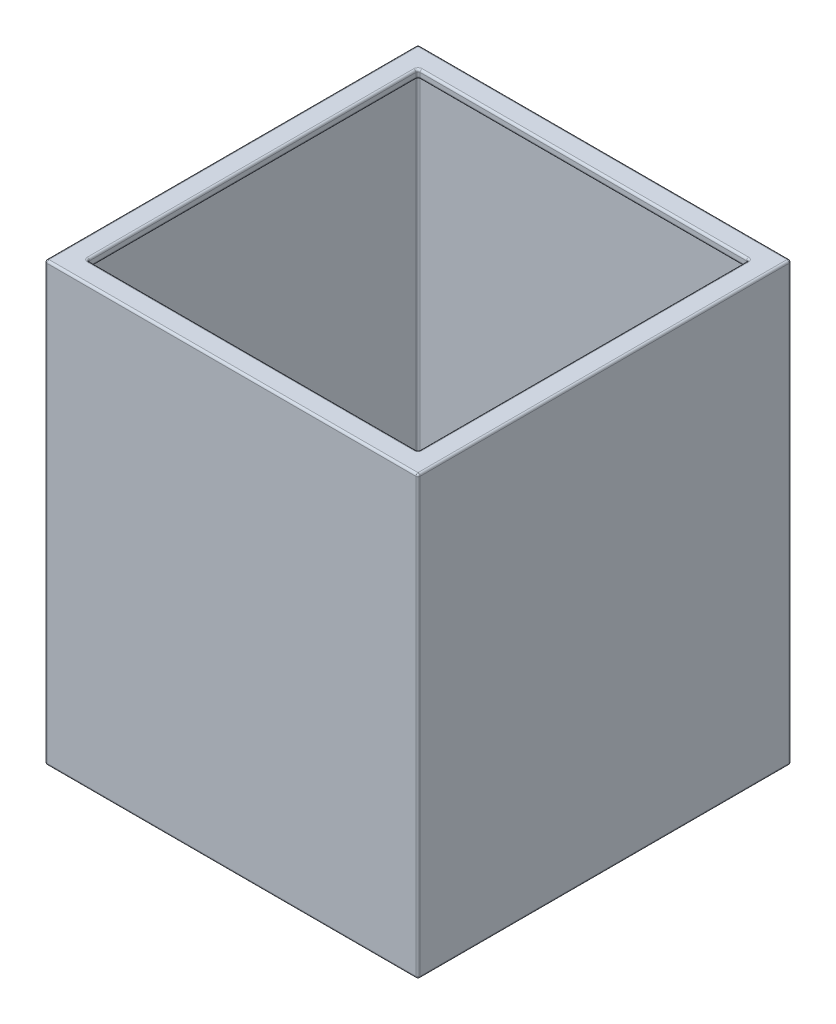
ISO-10303-21;
HEADER;
FILE_DESCRIPTION(('STEP AP214'),'2;1');
FILE_NAME('part.step','',(''),(''),'','','');
FILE_SCHEMA(('AUTOMOTIVE_DESIGN { 1 0 10303 214 1 1 1 1 }'));
ENDSEC;
DATA;
#1=APPLICATION_CONTEXT('core data for automotive mechanical design processes');
#2=APPLICATION_PROTOCOL_DEFINITION('international standard','automotive_design',2000,#1);
#3=PRODUCT_CONTEXT('',#1,'mechanical');
#4=PRODUCT('Part','Part','',(#3));
#5=PRODUCT_RELATED_PRODUCT_CATEGORY('part','',(#4));
#6=PRODUCT_DEFINITION_FORMATION('','',#4);
#7=PRODUCT_DEFINITION_CONTEXT('part definition',#1,'design');
#8=PRODUCT_DEFINITION('design','',#6,#7);
#9=PRODUCT_DEFINITION_SHAPE('','',#8);
#10=(LENGTH_UNIT() NAMED_UNIT(*) SI_UNIT(.MILLI.,.METRE.));
#11=(NAMED_UNIT(*) PLANE_ANGLE_UNIT() SI_UNIT($,.RADIAN.));
#12=(NAMED_UNIT(*) SI_UNIT($,.STERADIAN.) SOLID_ANGLE_UNIT());
#13=UNCERTAINTY_MEASURE_WITH_UNIT(LENGTH_MEASURE(1.E-05),#10,'distance_accuracy_value','');
#14=(GEOMETRIC_REPRESENTATION_CONTEXT(3) GLOBAL_UNCERTAINTY_ASSIGNED_CONTEXT((#13)) GLOBAL_UNIT_ASSIGNED_CONTEXT((#10,
#11,#12)) REPRESENTATION_CONTEXT('',''));
#15=CARTESIAN_POINT('',(0.,0.,0.));
#16=DIRECTION('',(0.,0.,1.));
#17=DIRECTION('',(1.,0.,0.));
#18=AXIS2_PLACEMENT_3D('',#15,#16,#17);
#19=CARTESIAN_POINT('',(6.35,-139.193969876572,-104.775));
#20=DIRECTION('',(-1.,0.,0.));
#21=DIRECTION('',(0.,0.,1.));
#22=AXIS2_PLACEMENT_3D('',#19,#20,#21);
#23=PLANE('',#22);
#24=DIRECTION('',(0.,0.,1.));
#25=VECTOR('',#24,1.);
#26=CARTESIAN_POINT('',(6.35,129.54,-104.775));
#27=LINE('',#26,#25);
#28=CARTESIAN_POINT('',(6.35,129.54,-104.14));
#29=VERTEX_POINT('',#28);
#30=CARTESIAN_POINT('',(6.35,129.54,-6.985));
#31=VERTEX_POINT('',#30);
#32=EDGE_CURVE('E428',#29,#31,#27,.T.);
#33=ORIENTED_EDGE('',*,*,#32,.T.);
#34=DIRECTION('',(0.,1.,0.));
#35=VECTOR('',#34,1.);
#36=CARTESIAN_POINT('',(6.35,127.635,-6.985));
#37=LINE('',#36,#35);
#38=CARTESIAN_POINT('',(6.35,128.27,-6.985));
#39=VERTEX_POINT('',#38);
#40=EDGE_CURVE('E433',#31,#39,#37,.F.);
#41=ORIENTED_EDGE('',*,*,#40,.T.);
#42=DIRECTION('',(0.,0.,1.));
#43=VECTOR('',#42,1.);
#44=CARTESIAN_POINT('',(6.35,128.27,-104.775));
#45=LINE('',#44,#43);
#46=CARTESIAN_POINT('',(6.35,128.27,-104.14));
#47=VERTEX_POINT('',#46);
#48=EDGE_CURVE('E430',#39,#47,#45,.F.);
#49=ORIENTED_EDGE('',*,*,#48,.T.);
#50=DIRECTION('',(0.,1.,0.));
#51=VECTOR('',#50,1.);
#52=CARTESIAN_POINT('',(6.35,130.175,-104.14));
#53=LINE('',#52,#51);
#54=EDGE_CURVE('E426',#47,#29,#53,.T.);
#55=ORIENTED_EDGE('',*,*,#54,.T.);
#56=EDGE_LOOP('',(#33,#41,#49,#55));
#57=FACE_BOUND('',#56,.T.);
#58=ADVANCED_FACE('F41',(#57),#23,.F.);
#59=CARTESIAN_POINT('',(6.35,-139.193969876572,-6.35));
#60=DIRECTION('',(0.,0.,1.));
#61=DIRECTION('',(1.,0.,0.));
#62=AXIS2_PLACEMENT_3D('',#59,#60,#61);
#63=PLANE('',#62);
#64=DIRECTION('',(1.,0.,0.));
#65=VECTOR('',#64,1.);
#66=CARTESIAN_POINT('',(6.35,128.27,-6.35));
#67=LINE('',#66,#65);
#68=CARTESIAN_POINT('',(104.14,128.27,-6.35));
#69=VERTEX_POINT('',#68);
#70=CARTESIAN_POINT('',(6.985,128.27,-6.35));
#71=VERTEX_POINT('',#70);
#72=EDGE_CURVE('E421',#69,#71,#67,.F.);
#73=ORIENTED_EDGE('',*,*,#72,.T.);
#74=DIRECTION('',(0.,1.,0.));
#75=VECTOR('',#74,1.);
#76=CARTESIAN_POINT('',(6.985,130.175,-6.35));
#77=LINE('',#76,#75);
#78=CARTESIAN_POINT('',(6.985,129.54,-6.35));
#79=VERTEX_POINT('',#78);
#80=EDGE_CURVE('E424',#71,#79,#77,.T.);
#81=ORIENTED_EDGE('',*,*,#80,.T.);
#82=DIRECTION('',(1.,0.,0.));
#83=VECTOR('',#82,1.);
#84=CARTESIAN_POINT('',(6.35,129.54,-6.35));
#85=LINE('',#84,#83);
#86=CARTESIAN_POINT('',(104.14,129.54,-6.35));
#87=VERTEX_POINT('',#86);
#88=EDGE_CURVE('E419',#79,#87,#85,.T.);
#89=ORIENTED_EDGE('',*,*,#88,.T.);
#90=DIRECTION('',(0.,1.,0.));
#91=VECTOR('',#90,1.);
#92=CARTESIAN_POINT('',(104.14,127.635,-6.35));
#93=LINE('',#92,#91);
#94=EDGE_CURVE('E417',#87,#69,#93,.F.);
#95=ORIENTED_EDGE('',*,*,#94,.T.);
#96=EDGE_LOOP('',(#73,#81,#89,#95));
#97=FACE_BOUND('',#96,.T.);
#98=ADVANCED_FACE('F788',(#97),#63,.F.);
#99=CARTESIAN_POINT('',(104.775,-139.193969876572,-6.35));
#100=DIRECTION('',(1.,0.,0.));
#101=DIRECTION('',(0.,0.,-1.));
#102=AXIS2_PLACEMENT_3D('',#99,#100,#101);
#103=PLANE('',#102);
#104=DIRECTION('',(0.,0.,-1.));
#105=VECTOR('',#104,1.);
#106=CARTESIAN_POINT('',(104.775,128.27,-6.35));
#107=LINE('',#106,#105);
#108=CARTESIAN_POINT('',(104.775,128.27,-104.14));
#109=VERTEX_POINT('',#108);
#110=CARTESIAN_POINT('',(104.775,128.27,-6.985));
#111=VERTEX_POINT('',#110);
#112=EDGE_CURVE('E412',#109,#111,#107,.F.);
#113=ORIENTED_EDGE('',*,*,#112,.T.);
#114=DIRECTION('',(0.,1.,0.));
#115=VECTOR('',#114,1.);
#116=CARTESIAN_POINT('',(104.775,130.175,-6.985));
#117=LINE('',#116,#115);
#118=CARTESIAN_POINT('',(104.775,129.54,-6.985));
#119=VERTEX_POINT('',#118);
#120=EDGE_CURVE('E415',#111,#119,#117,.T.);
#121=ORIENTED_EDGE('',*,*,#120,.T.);
#122=DIRECTION('',(0.,0.,-1.));
#123=VECTOR('',#122,1.);
#124=CARTESIAN_POINT('',(104.775,129.54,-6.35));
#125=LINE('',#124,#123);
#126=CARTESIAN_POINT('',(104.775,129.54,-104.14));
#127=VERTEX_POINT('',#126);
#128=EDGE_CURVE('E410',#119,#127,#125,.T.);
#129=ORIENTED_EDGE('',*,*,#128,.T.);
#130=DIRECTION('',(0.,1.,0.));
#131=VECTOR('',#130,1.);
#132=CARTESIAN_POINT('',(104.775,127.635,-104.14));
#133=LINE('',#132,#131);
#134=EDGE_CURVE('E408',#127,#109,#133,.F.);
#135=ORIENTED_EDGE('',*,*,#134,.T.);
#136=EDGE_LOOP('',(#113,#121,#129,#135));
#137=FACE_BOUND('',#136,.T.);
#138=ADVANCED_FACE('F794',(#137),#103,.F.);
#139=CARTESIAN_POINT('',(104.775,-139.193969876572,-104.775));
#140=DIRECTION('',(0.,0.,-1.));
#141=DIRECTION('',(-1.,0.,0.));
#142=AXIS2_PLACEMENT_3D('',#139,#140,#141);
#143=PLANE('',#142);
#144=DIRECTION('',(0.,1.,0.));
#145=VECTOR('',#144,1.);
#146=CARTESIAN_POINT('',(104.14,130.175,-104.775));
#147=LINE('',#146,#145);
#148=CARTESIAN_POINT('',(104.14,128.27,-104.775));
#149=VERTEX_POINT('',#148);
#150=CARTESIAN_POINT('',(104.14,129.54,-104.775));
#151=VERTEX_POINT('',#150);
#152=EDGE_CURVE('E439',#149,#151,#147,.T.);
#153=ORIENTED_EDGE('',*,*,#152,.T.);
#154=DIRECTION('',(-1.,0.,0.));
#155=VECTOR('',#154,1.);
#156=CARTESIAN_POINT('',(104.775,129.54,-104.775));
#157=LINE('',#156,#155);
#158=CARTESIAN_POINT('',(6.985,129.54,-104.775));
#159=VERTEX_POINT('',#158);
#160=EDGE_CURVE('E441',#151,#159,#157,.T.);
#161=ORIENTED_EDGE('',*,*,#160,.T.);
#162=DIRECTION('',(0.,1.,0.));
#163=VECTOR('',#162,1.);
#164=CARTESIAN_POINT('',(6.985,127.635,-104.775));
#165=LINE('',#164,#163);
#166=CARTESIAN_POINT('',(6.985,128.27,-104.775));
#167=VERTEX_POINT('',#166);
#168=EDGE_CURVE('E437',#159,#167,#165,.F.);
#169=ORIENTED_EDGE('',*,*,#168,.T.);
#170=DIRECTION('',(-1.,0.,0.));
#171=VECTOR('',#170,1.);
#172=CARTESIAN_POINT('',(104.775,128.27,-104.775));
#173=LINE('',#172,#171);
#174=EDGE_CURVE('E435',#167,#149,#173,.F.);
#175=ORIENTED_EDGE('',*,*,#174,.T.);
#176=EDGE_LOOP('',(#153,#161,#169,#175));
#177=FACE_BOUND('',#176,.T.);
#178=ADVANCED_FACE('F819',(#177),#143,.F.);
#179=CARTESIAN_POINT('',(0.,130.175,0.));
#180=DIRECTION('',(1.,0.,0.));
#181=DIRECTION('',(0.,0.,-1.));
#182=AXIS2_PLACEMENT_3D('',#179,#180,#181);
#183=PLANE('',#182);
#184=DIRECTION('',(0.,0.,1.));
#185=VECTOR('',#184,1.);
#186=CARTESIAN_POINT('',(0.,129.54,0.));
#187=LINE('',#186,#185);
#188=CARTESIAN_POINT('',(0.,129.54,-0.635));
#189=VERTEX_POINT('',#188);
#190=CARTESIAN_POINT('',(0.,129.54,-110.49));
#191=VERTEX_POINT('',#190);
#192=EDGE_CURVE('E475',#189,#191,#187,.F.);
#193=ORIENTED_EDGE('',*,*,#192,.T.);
#194=DIRECTION('',(0.,-1.,0.));
#195=VECTOR('',#194,1.);
#196=CARTESIAN_POINT('',(0.,130.175,-110.49));
#197=LINE('',#196,#195);
#198=CARTESIAN_POINT('',(0.,0.634999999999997,-110.49));
#199=VERTEX_POINT('',#198);
#200=EDGE_CURVE('E480',#191,#199,#197,.T.);
#201=ORIENTED_EDGE('',*,*,#200,.T.);
#202=DIRECTION('',(0.,0.,1.));
#203=VECTOR('',#202,1.);
#204=CARTESIAN_POINT('',(0.,0.634999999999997,0.));
#205=LINE('',#204,#203);
#206=CARTESIAN_POINT('',(0.,0.634999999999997,-0.635));
#207=VERTEX_POINT('',#206);
#208=EDGE_CURVE('E477',#199,#207,#205,.T.);
#209=ORIENTED_EDGE('',*,*,#208,.T.);
#210=DIRECTION('',(0.,-1.,0.));
#211=VECTOR('',#210,1.);
#212=CARTESIAN_POINT('',(0.,130.175,-0.635));
#213=LINE('',#212,#211);
#214=EDGE_CURVE('E473',#207,#189,#213,.F.);
#215=ORIENTED_EDGE('',*,*,#214,.T.);
#216=EDGE_LOOP('',(#193,#201,#209,#215));
#217=FACE_BOUND('',#216,.T.);
#218=ADVANCED_FACE('F731',(#217),#183,.F.);
#219=CARTESIAN_POINT('',(0.,130.175,0.));
#220=DIRECTION('',(0.,0.,-1.));
#221=DIRECTION('',(-1.,0.,0.));
#222=AXIS2_PLACEMENT_3D('',#219,#220,#221);
#223=PLANE('',#222);
#224=DIRECTION('',(1.,0.,0.));
#225=VECTOR('',#224,1.);
#226=CARTESIAN_POINT('',(111.125,0.634999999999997,0.));
#227=LINE('',#226,#225);
#228=CARTESIAN_POINT('',(0.635,0.634999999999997,0.));
#229=VERTEX_POINT('',#228);
#230=CARTESIAN_POINT('',(110.49,0.634999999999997,0.));
#231=VERTEX_POINT('',#230);
#232=EDGE_CURVE('E495',#229,#231,#227,.T.);
#233=ORIENTED_EDGE('',*,*,#232,.T.);
#234=DIRECTION('',(0.,-1.,0.));
#235=VECTOR('',#234,1.);
#236=CARTESIAN_POINT('',(110.49,130.175,0.));
#237=LINE('',#236,#235);
#238=CARTESIAN_POINT('',(110.49,129.54,0.));
#239=VERTEX_POINT('',#238);
#240=EDGE_CURVE('E498',#231,#239,#237,.F.);
#241=ORIENTED_EDGE('',*,*,#240,.T.);
#242=DIRECTION('',(1.,0.,0.));
#243=VECTOR('',#242,1.);
#244=CARTESIAN_POINT('',(0.,129.54,0.));
#245=LINE('',#244,#243);
#246=CARTESIAN_POINT('',(0.635,129.54,0.));
#247=VERTEX_POINT('',#246);
#248=EDGE_CURVE('E493',#239,#247,#245,.F.);
#249=ORIENTED_EDGE('',*,*,#248,.T.);
#250=DIRECTION('',(0.,-1.,0.));
#251=VECTOR('',#250,1.);
#252=CARTESIAN_POINT('',(0.635,130.175,0.));
#253=LINE('',#252,#251);
#254=EDGE_CURVE('E491',#247,#229,#253,.T.);
#255=ORIENTED_EDGE('',*,*,#254,.T.);
#256=EDGE_LOOP('',(#233,#241,#249,#255));
#257=FACE_BOUND('',#256,.T.);
#258=ADVANCED_FACE('F813',(#257),#223,.F.);
#259=CARTESIAN_POINT('',(111.125,130.175,0.));
#260=DIRECTION('',(-1.,0.,0.));
#261=DIRECTION('',(0.,0.,1.));
#262=AXIS2_PLACEMENT_3D('',#259,#260,#261);
#263=PLANE('',#262);
#264=DIRECTION('',(0.,0.,-1.));
#265=VECTOR('',#264,1.);
#266=CARTESIAN_POINT('',(111.125,0.634999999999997,-111.125));
#267=LINE('',#266,#265);
#268=CARTESIAN_POINT('',(111.125,0.634999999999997,-0.635));
#269=VERTEX_POINT('',#268);
#270=CARTESIAN_POINT('',(111.125,0.634999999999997,-110.49));
#271=VERTEX_POINT('',#270);
#272=EDGE_CURVE('E504',#269,#271,#267,.T.);
#273=ORIENTED_EDGE('',*,*,#272,.T.);
#274=DIRECTION('',(0.,-1.,0.));
#275=VECTOR('',#274,1.);
#276=CARTESIAN_POINT('',(111.125,130.175,-110.49));
#277=LINE('',#276,#275);
#278=CARTESIAN_POINT('',(111.125,129.54,-110.49));
#279=VERTEX_POINT('',#278);
#280=EDGE_CURVE('E507',#271,#279,#277,.F.);
#281=ORIENTED_EDGE('',*,*,#280,.T.);
#282=DIRECTION('',(0.,0.,-1.));
#283=VECTOR('',#282,1.);
#284=CARTESIAN_POINT('',(111.125,129.54,0.));
#285=LINE('',#284,#283);
#286=CARTESIAN_POINT('',(111.125,129.54,-0.635));
#287=VERTEX_POINT('',#286);
#288=EDGE_CURVE('E502',#279,#287,#285,.F.);
#289=ORIENTED_EDGE('',*,*,#288,.T.);
#290=DIRECTION('',(0.,-1.,0.));
#291=VECTOR('',#290,1.);
#292=CARTESIAN_POINT('',(111.125,130.175,-0.635));
#293=LINE('',#292,#291);
#294=EDGE_CURVE('E500',#287,#269,#293,.T.);
#295=ORIENTED_EDGE('',*,*,#294,.T.);
#296=EDGE_LOOP('',(#273,#281,#289,#295));
#297=FACE_BOUND('',#296,.T.);
#298=ADVANCED_FACE('F755',(#297),#263,.F.);
#299=CARTESIAN_POINT('',(0.,130.175,-111.125));
#300=DIRECTION('',(0.,0.,1.));
#301=DIRECTION('',(1.,0.,0.));
#302=AXIS2_PLACEMENT_3D('',#299,#300,#301);
#303=PLANE('',#302);
#304=DIRECTION('',(-1.,0.,0.));
#305=VECTOR('',#304,1.);
#306=CARTESIAN_POINT('',(0.,129.54,-111.125));
#307=LINE('',#306,#305);
#308=CARTESIAN_POINT('',(0.635,129.54,-111.125));
#309=VERTEX_POINT('',#308);
#310=CARTESIAN_POINT('',(110.49,129.54,-111.125));
#311=VERTEX_POINT('',#310);
#312=EDGE_CURVE('E61',#309,#311,#307,.F.);
#313=ORIENTED_EDGE('',*,*,#312,.T.);
#314=DIRECTION('',(0.,-1.,0.));
#315=VECTOR('',#314,1.);
#316=CARTESIAN_POINT('',(110.49,130.175,-111.125));
#317=LINE('',#316,#315);
#318=CARTESIAN_POINT('',(110.49,0.634999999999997,-111.125));
#319=VERTEX_POINT('',#318);
#320=EDGE_CURVE('E12',#311,#319,#317,.T.);
#321=ORIENTED_EDGE('',*,*,#320,.T.);
#322=DIRECTION('',(-1.,0.,0.));
#323=VECTOR('',#322,1.);
#324=CARTESIAN_POINT('',(0.,0.634999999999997,-111.125));
#325=LINE('',#324,#323);
#326=CARTESIAN_POINT('',(0.635,0.634999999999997,-111.125));
#327=VERTEX_POINT('',#326);
#328=EDGE_CURVE('E50',#319,#327,#325,.T.);
#329=ORIENTED_EDGE('',*,*,#328,.T.);
#330=DIRECTION('',(0.,-1.,0.));
#331=VECTOR('',#330,1.);
#332=CARTESIAN_POINT('',(0.635,130.175,-111.125));
#333=LINE('',#332,#331);
#334=EDGE_CURVE('E509',#327,#309,#333,.F.);
#335=ORIENTED_EDGE('',*,*,#334,.T.);
#336=EDGE_LOOP('',(#313,#321,#329,#335));
#337=FACE_BOUND('',#336,.T.);
#338=ADVANCED_FACE('F717',(#337),#303,.F.);
#339=CARTESIAN_POINT('',(0.,130.175,0.));
#340=DIRECTION('',(0.,-1.,0.));
#341=DIRECTION('',(0.,0.,-1.));
#342=AXIS2_PLACEMENT_3D('',#339,#340,#341);
#343=PLANE('',#342);
#344=CARTESIAN_POINT('',(6.985,130.175,-6.985));
#345=DIRECTION('',(0.,-1.,0.));
#346=DIRECTION('',(0.,0.,-1.));
#347=AXIS2_PLACEMENT_3D('',#344,#345,#346);
#348=CIRCLE('',#347,1.27);
#349=CARTESIAN_POINT('',(5.715,130.175,-6.985));
#350=VERTEX_POINT('',#349);
#351=CARTESIAN_POINT('',(6.985,130.175,-5.715));
#352=VERTEX_POINT('',#351);
#353=EDGE_CURVE('E465',#350,#352,#348,.F.);
#354=ORIENTED_EDGE('',*,*,#353,.F.);
#355=DIRECTION('',(0.,0.,1.));
#356=VECTOR('',#355,1.);
#357=CARTESIAN_POINT('',(5.715,130.175,0.));
#358=LINE('',#357,#356);
#359=CARTESIAN_POINT('',(5.715,130.175,-104.14));
#360=VERTEX_POINT('',#359);
#361=EDGE_CURVE('E471',#350,#360,#358,.F.);
#362=ORIENTED_EDGE('',*,*,#361,.T.);
#363=CARTESIAN_POINT('',(6.985,130.175,-104.14));
#364=DIRECTION('',(0.,-1.,0.));
#365=DIRECTION('',(0.,0.,-1.));
#366=AXIS2_PLACEMENT_3D('',#363,#364,#365);
#367=CIRCLE('',#366,1.27);
#368=CARTESIAN_POINT('',(6.985,130.175,-105.41));
#369=VERTEX_POINT('',#368);
#370=EDGE_CURVE('E468',#369,#360,#367,.F.);
#371=ORIENTED_EDGE('',*,*,#370,.F.);
#372=DIRECTION('',(-1.,0.,0.));
#373=VECTOR('',#372,1.);
#374=CARTESIAN_POINT('',(0.,130.175,-105.41));
#375=LINE('',#374,#373);
#376=CARTESIAN_POINT('',(104.14,130.175,-105.41));
#377=VERTEX_POINT('',#376);
#378=EDGE_CURVE('E462',#369,#377,#375,.F.);
#379=ORIENTED_EDGE('',*,*,#378,.T.);
#380=CARTESIAN_POINT('',(104.14,130.175,-104.14));
#381=DIRECTION('',(0.,-1.,0.));
#382=DIRECTION('',(0.,0.,-1.));
#383=AXIS2_PLACEMENT_3D('',#380,#381,#382);
#384=CIRCLE('',#383,1.27);
#385=CARTESIAN_POINT('',(105.41,130.175,-104.14));
#386=VERTEX_POINT('',#385);
#387=EDGE_CURVE('E460',#386,#377,#384,.F.);
#388=ORIENTED_EDGE('',*,*,#387,.F.);
#389=DIRECTION('',(0.,0.,-1.));
#390=VECTOR('',#389,1.);
#391=CARTESIAN_POINT('',(105.41,130.175,0.));
#392=LINE('',#391,#390);
#393=CARTESIAN_POINT('',(105.41,130.175,-6.985));
#394=VERTEX_POINT('',#393);
#395=EDGE_CURVE('E456',#386,#394,#392,.F.);
#396=ORIENTED_EDGE('',*,*,#395,.T.);
#397=CARTESIAN_POINT('',(104.14,130.175,-6.985));
#398=DIRECTION('',(0.,-1.,0.));
#399=DIRECTION('',(0.,0.,-1.));
#400=AXIS2_PLACEMENT_3D('',#397,#398,#399);
#401=CIRCLE('',#400,1.27);
#402=CARTESIAN_POINT('',(104.14,130.175,-5.715));
#403=VERTEX_POINT('',#402);
#404=EDGE_CURVE('E453',#403,#394,#401,.F.);
#405=ORIENTED_EDGE('',*,*,#404,.F.);
#406=DIRECTION('',(1.,0.,0.));
#407=VECTOR('',#406,1.);
#408=CARTESIAN_POINT('',(0.,130.175,-5.715));
#409=LINE('',#408,#407);
#410=EDGE_CURVE('E458',#403,#352,#409,.F.);
#411=ORIENTED_EDGE('',*,*,#410,.T.);
#412=EDGE_LOOP('',(#354,#362,#371,#379,#388,#396,#405,#411));
#413=FACE_BOUND('',#412,.T.);
#414=DIRECTION('',(0.,0.,1.));
#415=VECTOR('',#414,1.);
#416=CARTESIAN_POINT('',(0.635,130.175,0.));
#417=LINE('',#416,#415);
#418=CARTESIAN_POINT('',(0.635,130.175,-110.49));
#419=VERTEX_POINT('',#418);
#420=CARTESIAN_POINT('',(0.635,130.175,-0.635));
#421=VERTEX_POINT('',#420);
#422=EDGE_CURVE('E444',#419,#421,#417,.T.);
#423=ORIENTED_EDGE('',*,*,#422,.T.);
#424=DIRECTION('',(1.,0.,0.));
#425=VECTOR('',#424,1.);
#426=CARTESIAN_POINT('',(0.,130.175,-0.635));
#427=LINE('',#426,#425);
#428=CARTESIAN_POINT('',(110.49,130.175,-0.635));
#429=VERTEX_POINT('',#428);
#430=EDGE_CURVE('E450',#421,#429,#427,.T.);
#431=ORIENTED_EDGE('',*,*,#430,.T.);
#432=DIRECTION('',(0.,0.,-1.));
#433=VECTOR('',#432,1.);
#434=CARTESIAN_POINT('',(110.49,130.175,0.));
#435=LINE('',#434,#433);
#436=CARTESIAN_POINT('',(110.49,130.175,-110.49));
#437=VERTEX_POINT('',#436);
#438=EDGE_CURVE('E448',#429,#437,#435,.T.);
#439=ORIENTED_EDGE('',*,*,#438,.T.);
#440=DIRECTION('',(-1.,0.,0.));
#441=VECTOR('',#440,1.);
#442=CARTESIAN_POINT('',(0.,130.175,-110.49));
#443=LINE('',#442,#441);
#444=EDGE_CURVE('E446',#437,#419,#443,.T.);
#445=ORIENTED_EDGE('',*,*,#444,.T.);
#446=EDGE_LOOP('',(#423,#431,#439,#445));
#447=FACE_BOUND('',#446,.T.);
#448=ADVANCED_FACE('F741',(#413,#447),#343,.F.);
#449=CARTESIAN_POINT('',(0.,0.,0.));
#450=DIRECTION('',(0.,-1.,0.));
#451=DIRECTION('',(0.,0.,-1.));
#452=AXIS2_PLACEMENT_3D('',#449,#450,#451);
#453=PLANE('',#452);
#454=DIRECTION('',(1.,0.,0.));
#455=VECTOR('',#454,1.);
#456=CARTESIAN_POINT('',(0.,0.,-0.635));
#457=LINE('',#456,#455);
#458=CARTESIAN_POINT('',(110.49,0.,-0.635));
#459=VERTEX_POINT('',#458);
#460=CARTESIAN_POINT('',(0.635,0.,-0.635));
#461=VERTEX_POINT('',#460);
#462=EDGE_CURVE('E486',#459,#461,#457,.F.);
#463=ORIENTED_EDGE('',*,*,#462,.T.);
#464=DIRECTION('',(0.,0.,1.));
#465=VECTOR('',#464,1.);
#466=CARTESIAN_POINT('',(0.635,0.,-111.125));
#467=LINE('',#466,#465);
#468=CARTESIAN_POINT('',(0.635,0.,-110.49));
#469=VERTEX_POINT('',#468);
#470=EDGE_CURVE('E488',#461,#469,#467,.F.);
#471=ORIENTED_EDGE('',*,*,#470,.T.);
#472=DIRECTION('',(-1.,0.,0.));
#473=VECTOR('',#472,1.);
#474=CARTESIAN_POINT('',(111.125,0.,-110.49));
#475=LINE('',#474,#473);
#476=CARTESIAN_POINT('',(110.49,0.,-110.49));
#477=VERTEX_POINT('',#476);
#478=EDGE_CURVE('E482',#469,#477,#475,.F.);
#479=ORIENTED_EDGE('',*,*,#478,.T.);
#480=DIRECTION('',(0.,0.,-1.));
#481=VECTOR('',#480,1.);
#482=CARTESIAN_POINT('',(110.49,0.,0.));
#483=LINE('',#482,#481);
#484=EDGE_CURVE('E484',#477,#459,#483,.F.);
#485=ORIENTED_EDGE('',*,*,#484,.T.);
#486=EDGE_LOOP('',(#463,#471,#479,#485));
#487=FACE_BOUND('',#486,.T.);
#488=ADVANCED_FACE('F762',(#487),#453,.T.);
#489=CARTESIAN_POINT('',(0.,127.635,0.));
#490=DIRECTION('',(0.,-1.,0.));
#491=DIRECTION('',(0.,0.,-1.));
#492=AXIS2_PLACEMENT_3D('',#489,#490,#491);
#493=PLANE('',#492);
#494=CARTESIAN_POINT('',(6.985,127.635,-6.985));
#495=DIRECTION('',(0.,-1.,0.));
#496=DIRECTION('',(0.,0.,-1.));
#497=AXIS2_PLACEMENT_3D('',#494,#495,#496);
#498=CIRCLE('',#497,1.27);
#499=CARTESIAN_POINT('',(6.985,127.635,-5.715));
#500=VERTEX_POINT('',#499);
#501=CARTESIAN_POINT('',(5.715,127.635,-6.985));
#502=VERTEX_POINT('',#501);
#503=EDGE_CURVE('E400',#500,#502,#498,.T.);
#504=ORIENTED_EDGE('',*,*,#503,.F.);
#505=DIRECTION('',(1.,0.,0.));
#506=VECTOR('',#505,1.);
#507=CARTESIAN_POINT('',(104.775,127.635,-5.715));
#508=LINE('',#507,#506);
#509=CARTESIAN_POINT('',(104.14,127.635,-5.715));
#510=VERTEX_POINT('',#509);
#511=EDGE_CURVE('E406',#500,#510,#508,.T.);
#512=ORIENTED_EDGE('',*,*,#511,.T.);
#513=CARTESIAN_POINT('',(104.14,127.635,-6.985));
#514=DIRECTION('',(0.,-1.,0.));
#515=DIRECTION('',(0.,0.,-1.));
#516=AXIS2_PLACEMENT_3D('',#513,#514,#515);
#517=CIRCLE('',#516,1.27);
#518=CARTESIAN_POINT('',(105.41,127.635,-6.985));
#519=VERTEX_POINT('',#518);
#520=EDGE_CURVE('E403',#519,#510,#517,.T.);
#521=ORIENTED_EDGE('',*,*,#520,.F.);
#522=DIRECTION('',(0.,0.,-1.));
#523=VECTOR('',#522,1.);
#524=CARTESIAN_POINT('',(105.41,127.635,-104.775));
#525=LINE('',#524,#523);
#526=CARTESIAN_POINT('',(105.41,127.635,-104.14));
#527=VERTEX_POINT('',#526);
#528=EDGE_CURVE('E397',#519,#527,#525,.T.);
#529=ORIENTED_EDGE('',*,*,#528,.T.);
#530=CARTESIAN_POINT('',(104.14,127.635,-104.14));
#531=DIRECTION('',(0.,-1.,0.));
#532=DIRECTION('',(0.,0.,-1.));
#533=AXIS2_PLACEMENT_3D('',#530,#531,#532);
#534=CIRCLE('',#533,1.27);
#535=CARTESIAN_POINT('',(104.14,127.635,-105.41));
#536=VERTEX_POINT('',#535);
#537=EDGE_CURVE('E394',#536,#527,#534,.T.);
#538=ORIENTED_EDGE('',*,*,#537,.F.);
#539=DIRECTION('',(-1.,0.,0.));
#540=VECTOR('',#539,1.);
#541=CARTESIAN_POINT('',(6.35000000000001,127.635,-105.41));
#542=LINE('',#541,#540);
#543=CARTESIAN_POINT('',(6.985,127.635,-105.41));
#544=VERTEX_POINT('',#543);
#545=EDGE_CURVE('E390',#536,#544,#542,.T.);
#546=ORIENTED_EDGE('',*,*,#545,.T.);
#547=CARTESIAN_POINT('',(6.985,127.635,-104.14));
#548=DIRECTION('',(0.,-1.,0.));
#549=DIRECTION('',(0.,0.,-1.));
#550=AXIS2_PLACEMENT_3D('',#547,#548,#549);
#551=CIRCLE('',#550,1.27);
#552=CARTESIAN_POINT('',(5.715,127.635,-104.14));
#553=VERTEX_POINT('',#552);
#554=EDGE_CURVE('E387',#553,#544,#551,.T.);
#555=ORIENTED_EDGE('',*,*,#554,.F.);
#556=DIRECTION('',(0.,0.,1.));
#557=VECTOR('',#556,1.);
#558=CARTESIAN_POINT('',(5.715,127.635,-6.35));
#559=LINE('',#558,#557);
#560=EDGE_CURVE('E392',#553,#502,#559,.T.);
#561=ORIENTED_EDGE('',*,*,#560,.T.);
#562=EDGE_LOOP('',(#504,#512,#521,#529,#538,#546,#555,#561));
#563=FACE_BOUND('',#562,.T.);
#564=DIRECTION('',(0.,0.,-1.));
#565=VECTOR('',#564,1.);
#566=CARTESIAN_POINT('',(3.175,127.635,-108.585));
#567=LINE('',#566,#565);
#568=CARTESIAN_POINT('',(3.175,127.635,-3.175));
#569=VERTEX_POINT('',#568);
#570=CARTESIAN_POINT('',(3.175,127.635,-107.95));
#571=VERTEX_POINT('',#570);
#572=EDGE_CURVE('E380',#569,#571,#567,.T.);
#573=ORIENTED_EDGE('',*,*,#572,.T.);
#574=DIRECTION('',(1.,0.,0.));
#575=VECTOR('',#574,1.);
#576=CARTESIAN_POINT('',(108.585,127.635,-107.95));
#577=LINE('',#576,#575);
#578=CARTESIAN_POINT('',(107.95,127.635,-107.95));
#579=VERTEX_POINT('',#578);
#580=EDGE_CURVE('E385',#571,#579,#577,.T.);
#581=ORIENTED_EDGE('',*,*,#580,.T.);
#582=DIRECTION('',(0.,0.,1.));
#583=VECTOR('',#582,1.);
#584=CARTESIAN_POINT('',(107.95,127.635,-2.54));
#585=LINE('',#584,#583);
#586=CARTESIAN_POINT('',(107.95,127.635,-3.175));
#587=VERTEX_POINT('',#586);
#588=EDGE_CURVE('E382',#579,#587,#585,.T.);
#589=ORIENTED_EDGE('',*,*,#588,.T.);
#590=DIRECTION('',(-1.,0.,0.));
#591=VECTOR('',#590,1.);
#592=CARTESIAN_POINT('',(2.54,127.635,-3.175));
#593=LINE('',#592,#591);
#594=EDGE_CURVE('E378',#587,#569,#593,.T.);
#595=ORIENTED_EDGE('',*,*,#594,.T.);
#596=EDGE_LOOP('',(#573,#581,#589,#595));
#597=FACE_BOUND('',#596,.T.);
#598=ADVANCED_FACE('F808',(#563,#597),#493,.T.);
#599=CARTESIAN_POINT('',(108.585,280.145277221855,-2.54));
#600=DIRECTION('',(-1.,0.,0.));
#601=DIRECTION('',(0.,0.,1.));
#602=AXIS2_PLACEMENT_3D('',#599,#600,#601);
#603=PLANE('',#602);
#604=DIRECTION('',(0.,0.,-1.));
#605=VECTOR('',#604,1.);
#606=CARTESIAN_POINT('',(108.585,3.17499999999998,-2.54));
#607=LINE('',#606,#605);
#608=CARTESIAN_POINT('',(108.585,3.175,-107.95));
#609=VERTEX_POINT('',#608);
#610=CARTESIAN_POINT('',(108.585,3.175,-3.175));
#611=VERTEX_POINT('',#610);
#612=EDGE_CURVE('E373',#609,#611,#607,.F.);
#613=ORIENTED_EDGE('',*,*,#612,.T.);
#614=DIRECTION('',(0.,-1.,0.));
#615=VECTOR('',#614,1.);
#616=CARTESIAN_POINT('',(108.585,127.635,-3.175));
#617=LINE('',#616,#615);
#618=CARTESIAN_POINT('',(108.585,127.,-3.175));
#619=VERTEX_POINT('',#618);
#620=EDGE_CURVE('E376',#611,#619,#617,.F.);
#621=ORIENTED_EDGE('',*,*,#620,.T.);
#622=DIRECTION('',(0.,0.,1.));
#623=VECTOR('',#622,1.);
#624=CARTESIAN_POINT('',(108.585,127.,-108.585));
#625=LINE('',#624,#623);
#626=CARTESIAN_POINT('',(108.585,127.,-107.95));
#627=VERTEX_POINT('',#626);
#628=EDGE_CURVE('E371',#619,#627,#625,.F.);
#629=ORIENTED_EDGE('',*,*,#628,.T.);
#630=DIRECTION('',(0.,-1.,0.));
#631=VECTOR('',#630,1.);
#632=CARTESIAN_POINT('',(108.585,2.53999999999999,-107.95));
#633=LINE('',#632,#631);
#634=EDGE_CURVE('E369',#627,#609,#633,.T.);
#635=ORIENTED_EDGE('',*,*,#634,.T.);
#636=EDGE_LOOP('',(#613,#621,#629,#635));
#637=FACE_BOUND('',#636,.T.);
#638=ADVANCED_FACE('F1349',(#637),#603,.T.);
#639=CARTESIAN_POINT('',(2.54,280.145277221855,-2.54));
#640=DIRECTION('',(0.,0.,-1.));
#641=DIRECTION('',(-1.,0.,0.));
#642=AXIS2_PLACEMENT_3D('',#639,#640,#641);
#643=PLANE('',#642);
#644=DIRECTION('',(1.,0.,0.));
#645=VECTOR('',#644,1.);
#646=CARTESIAN_POINT('',(2.54,3.17499999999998,-2.54));
#647=LINE('',#646,#645);
#648=CARTESIAN_POINT('',(107.95,3.175,-2.54));
#649=VERTEX_POINT('',#648);
#650=CARTESIAN_POINT('',(3.175,3.175,-2.54));
#651=VERTEX_POINT('',#650);
#652=EDGE_CURVE('E316',#649,#651,#647,.F.);
#653=ORIENTED_EDGE('',*,*,#652,.T.);
#654=DIRECTION('',(0.,-1.,0.));
#655=VECTOR('',#654,1.);
#656=CARTESIAN_POINT('',(3.175,127.635,-2.54));
#657=LINE('',#656,#655);
#658=CARTESIAN_POINT('',(3.175,127.,-2.54));
#659=VERTEX_POINT('',#658);
#660=EDGE_CURVE('E367',#651,#659,#657,.F.);
#661=ORIENTED_EDGE('',*,*,#660,.T.);
#662=DIRECTION('',(-1.,0.,0.));
#663=VECTOR('',#662,1.);
#664=CARTESIAN_POINT('',(108.585,127.,-2.54));
#665=LINE('',#664,#663);
#666=CARTESIAN_POINT('',(107.95,127.,-2.54));
#667=VERTEX_POINT('',#666);
#668=EDGE_CURVE('E364',#659,#667,#665,.F.);
#669=ORIENTED_EDGE('',*,*,#668,.T.);
#670=DIRECTION('',(0.,-1.,0.));
#671=VECTOR('',#670,1.);
#672=CARTESIAN_POINT('',(107.95,2.53999999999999,-2.54));
#673=LINE('',#672,#671);
#674=EDGE_CURVE('E362',#667,#649,#673,.T.);
#675=ORIENTED_EDGE('',*,*,#674,.T.);
#676=EDGE_LOOP('',(#653,#661,#669,#675));
#677=FACE_BOUND('',#676,.T.);
#678=ADVANCED_FACE('F1340',(#677),#643,.T.);
#679=CARTESIAN_POINT('',(2.54,280.145277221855,-108.585));
#680=DIRECTION('',(1.,0.,0.));
#681=DIRECTION('',(0.,0.,-1.));
#682=AXIS2_PLACEMENT_3D('',#679,#680,#681);
#683=PLANE('',#682);
#684=DIRECTION('',(0.,0.,-1.));
#685=VECTOR('',#684,1.);
#686=CARTESIAN_POINT('',(2.54,127.,-2.54));
#687=LINE('',#686,#685);
#688=CARTESIAN_POINT('',(2.54,127.,-107.95));
#689=VERTEX_POINT('',#688);
#690=CARTESIAN_POINT('',(2.54,127.,-3.175));
#691=VERTEX_POINT('',#690);
#692=EDGE_CURVE('E355',#689,#691,#687,.F.);
#693=ORIENTED_EDGE('',*,*,#692,.T.);
#694=DIRECTION('',(0.,-1.,0.));
#695=VECTOR('',#694,1.);
#696=CARTESIAN_POINT('',(2.54,2.53999999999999,-3.175));
#697=LINE('',#696,#695);
#698=CARTESIAN_POINT('',(2.54,3.175,-3.175));
#699=VERTEX_POINT('',#698);
#700=EDGE_CURVE('E360',#691,#699,#697,.T.);
#701=ORIENTED_EDGE('',*,*,#700,.T.);
#702=DIRECTION('',(0.,0.,1.));
#703=VECTOR('',#702,1.);
#704=CARTESIAN_POINT('',(2.54,3.17499999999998,-108.585));
#705=LINE('',#704,#703);
#706=CARTESIAN_POINT('',(2.54,3.175,-107.95));
#707=VERTEX_POINT('',#706);
#708=EDGE_CURVE('E357',#699,#707,#705,.F.);
#709=ORIENTED_EDGE('',*,*,#708,.T.);
#710=DIRECTION('',(0.,-1.,0.));
#711=VECTOR('',#710,1.);
#712=CARTESIAN_POINT('',(2.54,127.635,-107.95));
#713=LINE('',#712,#711);
#714=EDGE_CURVE('E353',#707,#689,#713,.F.);
#715=ORIENTED_EDGE('',*,*,#714,.T.);
#716=EDGE_LOOP('',(#693,#701,#709,#715));
#717=FACE_BOUND('',#716,.T.);
#718=ADVANCED_FACE('F1331',(#717),#683,.T.);
#719=CARTESIAN_POINT('',(108.585,280.145277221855,-108.585));
#720=DIRECTION('',(0.,0.,1.));
#721=DIRECTION('',(1.,0.,0.));
#722=AXIS2_PLACEMENT_3D('',#719,#720,#721);
#723=PLANE('',#722);
#724=DIRECTION('',(1.,0.,0.));
#725=VECTOR('',#724,1.);
#726=CARTESIAN_POINT('',(2.54,127.,-108.585));
#727=LINE('',#726,#725);
#728=CARTESIAN_POINT('',(107.95,127.,-108.585));
#729=VERTEX_POINT('',#728);
#730=CARTESIAN_POINT('',(3.175,127.,-108.585));
#731=VERTEX_POINT('',#730);
#732=EDGE_CURVE('E346',#729,#731,#727,.F.);
#733=ORIENTED_EDGE('',*,*,#732,.T.);
#734=DIRECTION('',(0.,-1.,0.));
#735=VECTOR('',#734,1.);
#736=CARTESIAN_POINT('',(3.175,2.53999999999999,-108.585));
#737=LINE('',#736,#735);
#738=CARTESIAN_POINT('',(3.175,3.175,-108.585));
#739=VERTEX_POINT('',#738);
#740=EDGE_CURVE('E351',#731,#739,#737,.T.);
#741=ORIENTED_EDGE('',*,*,#740,.T.);
#742=DIRECTION('',(-1.,0.,0.));
#743=VECTOR('',#742,1.);
#744=CARTESIAN_POINT('',(108.585,3.17499999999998,-108.585));
#745=LINE('',#744,#743);
#746=CARTESIAN_POINT('',(107.95,3.175,-108.585));
#747=VERTEX_POINT('',#746);
#748=EDGE_CURVE('E348',#739,#747,#745,.F.);
#749=ORIENTED_EDGE('',*,*,#748,.T.);
#750=DIRECTION('',(0.,-1.,0.));
#751=VECTOR('',#750,1.);
#752=CARTESIAN_POINT('',(107.95,127.635,-108.585));
#753=LINE('',#752,#751);
#754=EDGE_CURVE('E344',#747,#729,#753,.F.);
#755=ORIENTED_EDGE('',*,*,#754,.T.);
#756=EDGE_LOOP('',(#733,#741,#749,#755));
#757=FACE_BOUND('',#756,.T.);
#758=ADVANCED_FACE('F802',(#757),#723,.T.);
#759=CARTESIAN_POINT('',(0.,2.54,0.));
#760=DIRECTION('',(0.,-1.,0.));
#761=DIRECTION('',(0.,0.,-1.));
#762=AXIS2_PLACEMENT_3D('',#759,#760,#761);
#763=PLANE('',#762);
#764=DIRECTION('',(0.,0.,-1.));
#765=VECTOR('',#764,1.);
#766=CARTESIAN_POINT('',(107.95,2.54,0.));
#767=LINE('',#766,#765);
#768=CARTESIAN_POINT('',(107.95,2.54,-3.175));
#769=VERTEX_POINT('',#768);
#770=CARTESIAN_POINT('',(107.95,2.54,-107.95));
#771=VERTEX_POINT('',#770);
#772=EDGE_CURVE('E302',#769,#771,#767,.T.);
#773=ORIENTED_EDGE('',*,*,#772,.T.);
#774=DIRECTION('',(-1.,0.,0.));
#775=VECTOR('',#774,1.);
#776=CARTESIAN_POINT('',(0.,2.54,-107.95));
#777=LINE('',#776,#775);
#778=CARTESIAN_POINT('',(3.175,2.54,-107.95));
#779=VERTEX_POINT('',#778);
#780=EDGE_CURVE('E342',#771,#779,#777,.T.);
#781=ORIENTED_EDGE('',*,*,#780,.T.);
#782=DIRECTION('',(0.,0.,1.));
#783=VECTOR('',#782,1.);
#784=CARTESIAN_POINT('',(3.175,2.54,0.));
#785=LINE('',#784,#783);
#786=CARTESIAN_POINT('',(3.175,2.54,-3.175));
#787=VERTEX_POINT('',#786);
#788=EDGE_CURVE('E305',#779,#787,#785,.T.);
#789=ORIENTED_EDGE('',*,*,#788,.T.);
#790=DIRECTION('',(1.,0.,0.));
#791=VECTOR('',#790,1.);
#792=CARTESIAN_POINT('',(0.,2.54,-3.175));
#793=LINE('',#792,#791);
#794=EDGE_CURVE('E297',#787,#769,#793,.T.);
#795=ORIENTED_EDGE('',*,*,#794,.T.);
#796=EDGE_LOOP('',(#773,#781,#789,#795));
#797=FACE_BOUND('',#796,.T.);
#798=ADVANCED_FACE('F299',(#797),#763,.F.);
#799=CARTESIAN_POINT('',(0.,127.,-3.175));
#800=DIRECTION('',(1.,0.,0.));
#801=DIRECTION('',(0.,0.,-1.));
#802=AXIS2_PLACEMENT_3D('',#799,#800,#801);
#803=CYLINDRICAL_SURFACE('',#802,0.635);
#804=CARTESIAN_POINT('',(107.95,127.,-3.175));
#805=DIRECTION('',(-1.,0.,0.));
#806=DIRECTION('',(0.,0.,1.));
#807=AXIS2_PLACEMENT_3D('',#804,#805,#806);
#808=CIRCLE('',#807,0.635);
#809=EDGE_CURVE('E335',#667,#587,#808,.T.);
#810=ORIENTED_EDGE('',*,*,#809,.F.);
#811=ORIENTED_EDGE('',*,*,#668,.F.);
#812=CARTESIAN_POINT('',(3.175,127.,-3.175));
#813=DIRECTION('',(1.,0.,0.));
#814=DIRECTION('',(0.,0.,-1.));
#815=AXIS2_PLACEMENT_3D('',#812,#813,#814);
#816=CIRCLE('',#815,0.635);
#817=EDGE_CURVE('E338',#569,#659,#816,.T.);
#818=ORIENTED_EDGE('',*,*,#817,.F.);
#819=ORIENTED_EDGE('',*,*,#594,.F.);
#820=EDGE_LOOP('',(#810,#811,#818,#819));
#821=FACE_BOUND('',#820,.T.);
#822=ADVANCED_FACE('F801',(#821),#803,.F.);
#823=CARTESIAN_POINT('',(107.95,127.,-3.175));
#824=DIRECTION('',(0.,0.,1.));
#825=DIRECTION('',(1.,0.,0.));
#826=AXIS2_PLACEMENT_3D('',#823,#824,#825);
#827=SPHERICAL_SURFACE('',#826,0.635);
#828=CARTESIAN_POINT('',(107.95,127.,-3.175));
#829=DIRECTION('',(0.,-1.,0.));
#830=DIRECTION('',(0.,0.,-1.));
#831=AXIS2_PLACEMENT_3D('',#828,#829,#830);
#832=CIRCLE('',#831,0.635);
#833=EDGE_CURVE('E556',#667,#619,#832,.F.);
#834=ORIENTED_EDGE('',*,*,#833,.F.);
#835=ORIENTED_EDGE('',*,*,#809,.T.);
#836=CARTESIAN_POINT('',(107.95,127.,-3.175));
#837=DIRECTION('',(0.,0.,-1.));
#838=DIRECTION('',(-1.,0.,0.));
#839=AXIS2_PLACEMENT_3D('',#836,#837,#838);
#840=CIRCLE('',#839,0.635);
#841=EDGE_CURVE('E559',#619,#587,#840,.F.);
#842=ORIENTED_EDGE('',*,*,#841,.F.);
#843=EDGE_LOOP('',(#834,#835,#842));
#844=FACE_BOUND('',#843,.T.);
#845=ADVANCED_FACE('F886',(#844),#827,.F.);
#846=CARTESIAN_POINT('',(3.175,127.,-3.175));
#847=DIRECTION('',(0.,0.,1.));
#848=DIRECTION('',(1.,0.,0.));
#849=AXIS2_PLACEMENT_3D('',#846,#847,#848);
#850=SPHERICAL_SURFACE('',#849,0.635);
#851=CARTESIAN_POINT('',(3.175,127.,-3.175));
#852=DIRECTION('',(0.,0.,-1.));
#853=DIRECTION('',(0.,1.,0.));
#854=AXIS2_PLACEMENT_3D('',#851,#852,#853);
#855=CIRCLE('',#854,0.635);
#856=EDGE_CURVE('E550',#569,#691,#855,.F.);
#857=ORIENTED_EDGE('',*,*,#856,.F.);
#858=ORIENTED_EDGE('',*,*,#817,.T.);
#859=CARTESIAN_POINT('',(3.175,127.,-3.175));
#860=DIRECTION('',(0.,-1.,0.));
#861=DIRECTION('',(0.,0.,-1.));
#862=AXIS2_PLACEMENT_3D('',#859,#860,#861);
#863=CIRCLE('',#862,0.635);
#864=EDGE_CURVE('E553',#691,#659,#863,.F.);
#865=ORIENTED_EDGE('',*,*,#864,.F.);
#866=EDGE_LOOP('',(#857,#858,#865));
#867=FACE_BOUND('',#866,.T.);
#868=ADVANCED_FACE('F882',(#867),#850,.F.);
#869=CARTESIAN_POINT('',(107.95,127.,0.));
#870=DIRECTION('',(0.,0.,-1.));
#871=DIRECTION('',(-1.,0.,0.));
#872=AXIS2_PLACEMENT_3D('',#869,#870,#871);
#873=CYLINDRICAL_SURFACE('',#872,0.635);
#874=ORIENTED_EDGE('',*,*,#841,.T.);
#875=ORIENTED_EDGE('',*,*,#588,.F.);
#876=CARTESIAN_POINT('',(107.95,127.,-107.95));
#877=DIRECTION('',(0.,0.,1.));
#878=DIRECTION('',(1.,0.,0.));
#879=AXIS2_PLACEMENT_3D('',#876,#877,#878);
#880=CIRCLE('',#879,0.635);
#881=EDGE_CURVE('E544',#627,#579,#880,.T.);
#882=ORIENTED_EDGE('',*,*,#881,.F.);
#883=ORIENTED_EDGE('',*,*,#628,.F.);
#884=EDGE_LOOP('',(#874,#875,#882,#883));
#885=FACE_BOUND('',#884,.T.);
#886=ADVANCED_FACE('F878',(#885),#873,.F.);
#887=CARTESIAN_POINT('',(107.95,280.145277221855,-3.175));
#888=DIRECTION('',(0.,1.,0.));
#889=DIRECTION('',(0.,0.,1.));
#890=AXIS2_PLACEMENT_3D('',#887,#888,#889);
#891=CYLINDRICAL_SURFACE('',#890,0.635);
#892=ORIENTED_EDGE('',*,*,#833,.T.);
#893=ORIENTED_EDGE('',*,*,#620,.F.);
#894=CARTESIAN_POINT('',(107.95,3.175,-3.175));
#895=DIRECTION('',(0.,1.,0.));
#896=DIRECTION('',(0.,0.,1.));
#897=AXIS2_PLACEMENT_3D('',#894,#895,#896);
#898=CIRCLE('',#897,0.635);
#899=EDGE_CURVE('E320',#649,#611,#898,.T.);
#900=ORIENTED_EDGE('',*,*,#899,.F.);
#901=ORIENTED_EDGE('',*,*,#674,.F.);
#902=EDGE_LOOP('',(#892,#893,#900,#901));
#903=FACE_BOUND('',#902,.T.);
#904=ADVANCED_FACE('F875',(#903),#891,.F.);
#905=CARTESIAN_POINT('',(0.,3.175,-3.175));
#906=DIRECTION('',(1.,0.,0.));
#907=DIRECTION('',(0.,0.,-1.));
#908=AXIS2_PLACEMENT_3D('',#905,#906,#907);
#909=CYLINDRICAL_SURFACE('',#908,0.635);
#910=CARTESIAN_POINT('',(3.175,3.175,-3.175));
#911=DIRECTION('',(1.,0.,0.));
#912=DIRECTION('',(0.,0.,-1.));
#913=AXIS2_PLACEMENT_3D('',#910,#911,#912);
#914=CIRCLE('',#913,0.635);
#915=EDGE_CURVE('E321',#651,#787,#914,.T.);
#916=ORIENTED_EDGE('',*,*,#915,.F.);
#917=ORIENTED_EDGE('',*,*,#652,.F.);
#918=CARTESIAN_POINT('',(107.95,3.175,-3.175));
#919=DIRECTION('',(-1.,0.,0.));
#920=DIRECTION('',(0.,0.,1.));
#921=AXIS2_PLACEMENT_3D('',#918,#919,#920);
#922=CIRCLE('',#921,0.635);
#923=EDGE_CURVE('E312',#769,#649,#922,.T.);
#924=ORIENTED_EDGE('',*,*,#923,.F.);
#925=ORIENTED_EDGE('',*,*,#794,.F.);
#926=EDGE_LOOP('',(#916,#917,#924,#925));
#927=FACE_BOUND('',#926,.T.);
#928=ADVANCED_FACE('F314',(#927),#909,.F.);
#929=CARTESIAN_POINT('',(3.175,280.145277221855,-3.175));
#930=DIRECTION('',(0.,1.,0.));
#931=DIRECTION('',(0.,0.,1.));
#932=AXIS2_PLACEMENT_3D('',#929,#930,#931);
#933=CYLINDRICAL_SURFACE('',#932,0.635);
#934=ORIENTED_EDGE('',*,*,#864,.T.);
#935=ORIENTED_EDGE('',*,*,#660,.F.);
#936=CARTESIAN_POINT('',(3.175,3.175,-3.175));
#937=DIRECTION('',(0.,1.,0.));
#938=DIRECTION('',(0.,0.,1.));
#939=AXIS2_PLACEMENT_3D('',#936,#937,#938);
#940=CIRCLE('',#939,0.635);
#941=EDGE_CURVE('E540',#699,#651,#940,.T.);
#942=ORIENTED_EDGE('',*,*,#941,.F.);
#943=ORIENTED_EDGE('',*,*,#700,.F.);
#944=EDGE_LOOP('',(#934,#935,#942,#943));
#945=FACE_BOUND('',#944,.T.);
#946=ADVANCED_FACE('F868',(#945),#933,.F.);
#947=CARTESIAN_POINT('',(3.175,127.,0.));
#948=DIRECTION('',(0.,0.,1.));
#949=DIRECTION('',(1.,0.,0.));
#950=AXIS2_PLACEMENT_3D('',#947,#948,#949);
#951=CYLINDRICAL_SURFACE('',#950,0.635);
#952=ORIENTED_EDGE('',*,*,#856,.T.);
#953=ORIENTED_EDGE('',*,*,#692,.F.);
#954=CARTESIAN_POINT('',(3.175,127.,-107.95));
#955=DIRECTION('',(0.,0.,1.));
#956=DIRECTION('',(1.,0.,0.));
#957=AXIS2_PLACEMENT_3D('',#954,#955,#956);
#958=CIRCLE('',#957,0.635);
#959=EDGE_CURVE('E537',#571,#689,#958,.T.);
#960=ORIENTED_EDGE('',*,*,#959,.F.);
#961=ORIENTED_EDGE('',*,*,#572,.F.);
#962=EDGE_LOOP('',(#952,#953,#960,#961));
#963=FACE_BOUND('',#962,.T.);
#964=ADVANCED_FACE('F864',(#963),#951,.F.);
#965=CARTESIAN_POINT('',(0.,127.,-107.95));
#966=DIRECTION('',(-1.,0.,0.));
#967=DIRECTION('',(0.,0.,1.));
#968=AXIS2_PLACEMENT_3D('',#965,#966,#967);
#969=CYLINDRICAL_SURFACE('',#968,0.635);
#970=CARTESIAN_POINT('',(107.95,127.,-107.95));
#971=DIRECTION('',(-1.,0.,0.));
#972=DIRECTION('',(0.,0.,1.));
#973=AXIS2_PLACEMENT_3D('',#970,#971,#972);
#974=CIRCLE('',#973,0.635);
#975=EDGE_CURVE('E547',#579,#729,#974,.T.);
#976=ORIENTED_EDGE('',*,*,#975,.F.);
#977=ORIENTED_EDGE('',*,*,#580,.F.);
#978=CARTESIAN_POINT('',(3.175,127.,-107.95));
#979=DIRECTION('',(1.,0.,0.));
#980=DIRECTION('',(0.,1.,0.));
#981=AXIS2_PLACEMENT_3D('',#978,#979,#980);
#982=CIRCLE('',#981,0.635);
#983=EDGE_CURVE('E534',#731,#571,#982,.T.);
#984=ORIENTED_EDGE('',*,*,#983,.F.);
#985=ORIENTED_EDGE('',*,*,#732,.F.);
#986=EDGE_LOOP('',(#976,#977,#984,#985));
#987=FACE_BOUND('',#986,.T.);
#988=ADVANCED_FACE('F860',(#987),#969,.F.);
#989=CARTESIAN_POINT('',(107.95,127.,-107.95));
#990=DIRECTION('',(0.,0.,1.));
#991=DIRECTION('',(1.,0.,0.));
#992=AXIS2_PLACEMENT_3D('',#989,#990,#991);
#993=SPHERICAL_SURFACE('',#992,0.635);
#994=ORIENTED_EDGE('',*,*,#881,.T.);
#995=ORIENTED_EDGE('',*,*,#975,.T.);
#996=CARTESIAN_POINT('',(107.95,127.,-107.95));
#997=DIRECTION('',(0.,-1.,0.));
#998=DIRECTION('',(0.,0.,-1.));
#999=AXIS2_PLACEMENT_3D('',#996,#997,#998);
#1000=CIRCLE('',#999,0.635);
#1001=EDGE_CURVE('E328',#627,#729,#1000,.F.);
#1002=ORIENTED_EDGE('',*,*,#1001,.F.);
#1003=EDGE_LOOP('',(#994,#995,#1002));
#1004=FACE_BOUND('',#1003,.T.);
#1005=ADVANCED_FACE('F857',(#1004),#993,.F.);
#1006=CARTESIAN_POINT('',(107.95,3.175,-3.175));
#1007=DIRECTION('',(0.,0.,1.));
#1008=DIRECTION('',(1.,0.,0.));
#1009=AXIS2_PLACEMENT_3D('',#1006,#1007,#1008);
#1010=SPHERICAL_SURFACE('',#1009,0.635);
#1011=ORIENTED_EDGE('',*,*,#923,.T.);
#1012=ORIENTED_EDGE('',*,*,#899,.T.);
#1013=CARTESIAN_POINT('',(107.95,3.175,-3.175));
#1014=DIRECTION('',(0.,0.,-1.));
#1015=DIRECTION('',(-1.,0.,0.));
#1016=AXIS2_PLACEMENT_3D('',#1013,#1014,#1015);
#1017=CIRCLE('',#1016,0.635);
#1018=EDGE_CURVE('E323',#769,#611,#1017,.F.);
#1019=ORIENTED_EDGE('',*,*,#1018,.F.);
#1020=EDGE_LOOP('',(#1011,#1012,#1019));
#1021=FACE_BOUND('',#1020,.T.);
#1022=ADVANCED_FACE('F324',(#1021),#1010,.F.);
#1023=CARTESIAN_POINT('',(3.175,3.175,-3.175));
#1024=DIRECTION('',(0.,0.,1.));
#1025=DIRECTION('',(1.,0.,0.));
#1026=AXIS2_PLACEMENT_3D('',#1023,#1024,#1025);
#1027=SPHERICAL_SURFACE('',#1026,0.635);
#1028=ORIENTED_EDGE('',*,*,#941,.T.);
#1029=ORIENTED_EDGE('',*,*,#915,.T.);
#1030=CARTESIAN_POINT('',(3.175,3.175,-3.175));
#1031=DIRECTION('',(0.,0.,-1.));
#1032=DIRECTION('',(-1.,0.,0.));
#1033=AXIS2_PLACEMENT_3D('',#1030,#1031,#1032);
#1034=CIRCLE('',#1033,0.635);
#1035=EDGE_CURVE('E329',#699,#787,#1034,.F.);
#1036=ORIENTED_EDGE('',*,*,#1035,.F.);
#1037=EDGE_LOOP('',(#1028,#1029,#1036));
#1038=FACE_BOUND('',#1037,.T.);
#1039=ADVANCED_FACE('F850',(#1038),#1027,.F.);
#1040=CARTESIAN_POINT('',(3.175,127.,-107.95));
#1041=DIRECTION('',(0.,0.,1.));
#1042=DIRECTION('',(1.,0.,0.));
#1043=AXIS2_PLACEMENT_3D('',#1040,#1041,#1042);
#1044=SPHERICAL_SURFACE('',#1043,0.635);
#1045=ORIENTED_EDGE('',*,*,#983,.T.);
#1046=ORIENTED_EDGE('',*,*,#959,.T.);
#1047=CARTESIAN_POINT('',(3.175,127.,-107.95));
#1048=DIRECTION('',(0.,-1.,0.));
#1049=DIRECTION('',(0.,0.,-1.));
#1050=AXIS2_PLACEMENT_3D('',#1047,#1048,#1049);
#1051=CIRCLE('',#1050,0.635);
#1052=EDGE_CURVE('E527',#731,#689,#1051,.F.);
#1053=ORIENTED_EDGE('',*,*,#1052,.F.);
#1054=EDGE_LOOP('',(#1045,#1046,#1053));
#1055=FACE_BOUND('',#1054,.T.);
#1056=ADVANCED_FACE('F846',(#1055),#1044,.F.);
#1057=CARTESIAN_POINT('',(107.95,280.145277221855,-107.95));
#1058=DIRECTION('',(0.,1.,0.));
#1059=DIRECTION('',(0.,0.,1.));
#1060=AXIS2_PLACEMENT_3D('',#1057,#1058,#1059);
#1061=CYLINDRICAL_SURFACE('',#1060,0.635);
#1062=ORIENTED_EDGE('',*,*,#1001,.T.);
#1063=ORIENTED_EDGE('',*,*,#754,.F.);
#1064=CARTESIAN_POINT('',(107.95,3.175,-107.95));
#1065=DIRECTION('',(0.,1.,0.));
#1066=DIRECTION('',(0.,0.,1.));
#1067=AXIS2_PLACEMENT_3D('',#1064,#1065,#1066);
#1068=CIRCLE('',#1067,0.635);
#1069=EDGE_CURVE('E524',#609,#747,#1068,.T.);
#1070=ORIENTED_EDGE('',*,*,#1069,.F.);
#1071=ORIENTED_EDGE('',*,*,#634,.F.);
#1072=EDGE_LOOP('',(#1062,#1063,#1070,#1071));
#1073=FACE_BOUND('',#1072,.T.);
#1074=ADVANCED_FACE('F843',(#1073),#1061,.F.);
#1075=CARTESIAN_POINT('',(107.95,3.175,0.));
#1076=DIRECTION('',(0.,0.,-1.));
#1077=DIRECTION('',(-1.,0.,0.));
#1078=AXIS2_PLACEMENT_3D('',#1075,#1076,#1077);
#1079=CYLINDRICAL_SURFACE('',#1078,0.635);
#1080=ORIENTED_EDGE('',*,*,#1018,.T.);
#1081=ORIENTED_EDGE('',*,*,#612,.F.);
#1082=CARTESIAN_POINT('',(107.95,3.175,-107.95));
#1083=DIRECTION('',(0.,0.,1.));
#1084=DIRECTION('',(1.,0.,0.));
#1085=AXIS2_PLACEMENT_3D('',#1082,#1083,#1084);
#1086=CIRCLE('',#1085,0.635);
#1087=EDGE_CURVE('E333',#771,#609,#1086,.T.);
#1088=ORIENTED_EDGE('',*,*,#1087,.F.);
#1089=ORIENTED_EDGE('',*,*,#772,.F.);
#1090=EDGE_LOOP('',(#1080,#1081,#1088,#1089));
#1091=FACE_BOUND('',#1090,.T.);
#1092=ADVANCED_FACE('F331',(#1091),#1079,.F.);
#1093=CARTESIAN_POINT('',(3.175,3.175,0.));
#1094=DIRECTION('',(0.,0.,1.));
#1095=DIRECTION('',(1.,0.,0.));
#1096=AXIS2_PLACEMENT_3D('',#1093,#1094,#1095);
#1097=CYLINDRICAL_SURFACE('',#1096,0.635);
#1098=ORIENTED_EDGE('',*,*,#1035,.T.);
#1099=ORIENTED_EDGE('',*,*,#788,.F.);
#1100=CARTESIAN_POINT('',(3.175,3.175,-107.95));
#1101=DIRECTION('',(0.,0.,1.));
#1102=DIRECTION('',(1.,0.,0.));
#1103=AXIS2_PLACEMENT_3D('',#1100,#1101,#1102);
#1104=CIRCLE('',#1103,0.635);
#1105=EDGE_CURVE('E520',#707,#779,#1104,.T.);
#1106=ORIENTED_EDGE('',*,*,#1105,.F.);
#1107=ORIENTED_EDGE('',*,*,#708,.F.);
#1108=EDGE_LOOP('',(#1098,#1099,#1106,#1107));
#1109=FACE_BOUND('',#1108,.T.);
#1110=ADVANCED_FACE('F836',(#1109),#1097,.F.);
#1111=CARTESIAN_POINT('',(3.175,280.145277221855,-107.95));
#1112=DIRECTION('',(0.,1.,0.));
#1113=DIRECTION('',(0.,0.,1.));
#1114=AXIS2_PLACEMENT_3D('',#1111,#1112,#1113);
#1115=CYLINDRICAL_SURFACE('',#1114,0.635);
#1116=ORIENTED_EDGE('',*,*,#1052,.T.);
#1117=ORIENTED_EDGE('',*,*,#714,.F.);
#1118=CARTESIAN_POINT('',(3.175,3.175,-107.95));
#1119=DIRECTION('',(0.,1.,0.));
#1120=DIRECTION('',(0.,0.,1.));
#1121=AXIS2_PLACEMENT_3D('',#1118,#1119,#1120);
#1122=CIRCLE('',#1121,0.635);
#1123=EDGE_CURVE('E518',#739,#707,#1122,.T.);
#1124=ORIENTED_EDGE('',*,*,#1123,.F.);
#1125=ORIENTED_EDGE('',*,*,#740,.F.);
#1126=EDGE_LOOP('',(#1116,#1117,#1124,#1125));
#1127=FACE_BOUND('',#1126,.T.);
#1128=ADVANCED_FACE('F832',(#1127),#1115,.F.);
#1129=CARTESIAN_POINT('',(107.95,3.175,-107.95));
#1130=DIRECTION('',(0.,0.,1.));
#1131=DIRECTION('',(1.,0.,0.));
#1132=AXIS2_PLACEMENT_3D('',#1129,#1130,#1131);
#1133=SPHERICAL_SURFACE('',#1132,0.635);
#1134=ORIENTED_EDGE('',*,*,#1087,.T.);
#1135=ORIENTED_EDGE('',*,*,#1069,.T.);
#1136=CARTESIAN_POINT('',(107.95,3.175,-107.95));
#1137=DIRECTION('',(-1.,0.,0.));
#1138=DIRECTION('',(0.,0.,1.));
#1139=AXIS2_PLACEMENT_3D('',#1136,#1137,#1138);
#1140=CIRCLE('',#1139,0.635);
#1141=EDGE_CURVE('E515',#771,#747,#1140,.F.);
#1142=ORIENTED_EDGE('',*,*,#1141,.F.);
#1143=EDGE_LOOP('',(#1134,#1135,#1142));
#1144=FACE_BOUND('',#1143,.T.);
#1145=ADVANCED_FACE('F828',(#1144),#1133,.F.);
#1146=CARTESIAN_POINT('',(3.175,3.175,-107.95));
#1147=DIRECTION('',(0.,0.,1.));
#1148=DIRECTION('',(1.,0.,0.));
#1149=AXIS2_PLACEMENT_3D('',#1146,#1147,#1148);
#1150=SPHERICAL_SURFACE('',#1149,0.635);
#1151=ORIENTED_EDGE('',*,*,#1123,.T.);
#1152=ORIENTED_EDGE('',*,*,#1105,.T.);
#1153=CARTESIAN_POINT('',(3.175,3.175,-107.95));
#1154=DIRECTION('',(1.,0.,0.));
#1155=DIRECTION('',(0.,0.,-1.));
#1156=AXIS2_PLACEMENT_3D('',#1153,#1154,#1155);
#1157=CIRCLE('',#1156,0.635);
#1158=EDGE_CURVE('E513',#739,#779,#1157,.F.);
#1159=ORIENTED_EDGE('',*,*,#1158,.F.);
#1160=EDGE_LOOP('',(#1151,#1152,#1159));
#1161=FACE_BOUND('',#1160,.T.);
#1162=ADVANCED_FACE('F824',(#1161),#1150,.F.);
#1163=CARTESIAN_POINT('',(0.,3.175,-107.95));
#1164=DIRECTION('',(-1.,0.,0.));
#1165=DIRECTION('',(0.,0.,1.));
#1166=AXIS2_PLACEMENT_3D('',#1163,#1164,#1165);
#1167=CYLINDRICAL_SURFACE('',#1166,0.635);
#1168=ORIENTED_EDGE('',*,*,#1141,.T.);
#1169=ORIENTED_EDGE('',*,*,#748,.F.);
#1170=ORIENTED_EDGE('',*,*,#1158,.T.);
#1171=ORIENTED_EDGE('',*,*,#780,.F.);
#1172=EDGE_LOOP('',(#1168,#1169,#1170,#1171));
#1173=FACE_BOUND('',#1172,.T.);
#1174=ADVANCED_FACE('F820',(#1173),#1167,.F.);
#1175=CARTESIAN_POINT('',(5.715,129.54,-104.775));
#1176=DIRECTION('',(0.,0.,1.));
#1177=DIRECTION('',(1.,0.,0.));
#1178=AXIS2_PLACEMENT_3D('',#1175,#1176,#1177);
#1179=CYLINDRICAL_SURFACE('',#1178,0.635);
#1180=CARTESIAN_POINT('',(5.715,129.54,-104.14));
#1181=DIRECTION('',(0.,0.,-1.));
#1182=DIRECTION('',(-1.,0.,0.));
#1183=AXIS2_PLACEMENT_3D('',#1180,#1181,#1182);
#1184=CIRCLE('',#1183,0.635);
#1185=EDGE_CURVE('E625',#360,#29,#1184,.T.);
#1186=ORIENTED_EDGE('',*,*,#1185,.F.);
#1187=ORIENTED_EDGE('',*,*,#361,.F.);
#1188=CARTESIAN_POINT('',(5.715,129.54,-6.985));
#1189=DIRECTION('',(0.,0.,1.));
#1190=DIRECTION('',(1.,0.,0.));
#1191=AXIS2_PLACEMENT_3D('',#1188,#1189,#1190);
#1192=CIRCLE('',#1191,0.635);
#1193=EDGE_CURVE('E516',#31,#350,#1192,.T.);
#1194=ORIENTED_EDGE('',*,*,#1193,.F.);
#1195=ORIENTED_EDGE('',*,*,#32,.F.);
#1196=EDGE_LOOP('',(#1186,#1187,#1194,#1195));
#1197=FACE_BOUND('',#1196,.T.);
#1198=ADVANCED_FACE('F823',(#1197),#1179,.T.);
#1199=CARTESIAN_POINT('',(6.985,129.54,-6.985));
#1200=DIRECTION('',(0.,-1.,0.));
#1201=DIRECTION('',(0.,0.,-1.));
#1202=AXIS2_PLACEMENT_3D('',#1199,#1200,#1201);
#1203=TOROIDAL_SURFACE('',#1202,1.27,0.635);
#1204=ORIENTED_EDGE('',*,*,#1193,.T.);
#1205=ORIENTED_EDGE('',*,*,#353,.T.);
#1206=CARTESIAN_POINT('',(6.985,129.54,-5.715));
#1207=DIRECTION('',(-1.,0.,0.));
#1208=DIRECTION('',(0.,0.,1.));
#1209=AXIS2_PLACEMENT_3D('',#1206,#1207,#1208);
#1210=CIRCLE('',#1209,0.635);
#1211=EDGE_CURVE('E622',#79,#352,#1210,.F.);
#1212=ORIENTED_EDGE('',*,*,#1211,.F.);
#1213=CARTESIAN_POINT('',(6.985,129.54,-6.985));
#1214=DIRECTION('',(0.,-1.,0.));
#1215=DIRECTION('',(0.,0.,-1.));
#1216=AXIS2_PLACEMENT_3D('',#1213,#1214,#1215);
#1217=CIRCLE('',#1216,0.635);
#1218=EDGE_CURVE('E619',#31,#79,#1217,.F.);
#1219=ORIENTED_EDGE('',*,*,#1218,.F.);
#1220=EDGE_LOOP('',(#1204,#1205,#1212,#1219));
#1221=FACE_BOUND('',#1220,.T.);
#1222=ADVANCED_FACE('F965',(#1221),#1203,.T.);
#1223=CARTESIAN_POINT('',(6.985,129.54,-104.14));
#1224=DIRECTION('',(0.,-1.,0.));
#1225=DIRECTION('',(0.,0.,-1.));
#1226=AXIS2_PLACEMENT_3D('',#1223,#1224,#1225);
#1227=TOROIDAL_SURFACE('',#1226,1.27,0.635);
#1228=ORIENTED_EDGE('',*,*,#370,.T.);
#1229=ORIENTED_EDGE('',*,*,#1185,.T.);
#1230=CARTESIAN_POINT('',(6.985,129.54,-104.14));
#1231=DIRECTION('',(0.,-1.,0.));
#1232=DIRECTION('',(0.,0.,-1.));
#1233=AXIS2_PLACEMENT_3D('',#1230,#1231,#1232);
#1234=CIRCLE('',#1233,0.635);
#1235=EDGE_CURVE('E616',#159,#29,#1234,.F.);
#1236=ORIENTED_EDGE('',*,*,#1235,.F.);
#1237=CARTESIAN_POINT('',(6.985,129.54,-105.41));
#1238=DIRECTION('',(-1.,0.,0.));
#1239=DIRECTION('',(0.,0.,1.));
#1240=AXIS2_PLACEMENT_3D('',#1237,#1238,#1239);
#1241=CIRCLE('',#1240,0.635);
#1242=EDGE_CURVE('E613',#369,#159,#1241,.F.);
#1243=ORIENTED_EDGE('',*,*,#1242,.F.);
#1244=EDGE_LOOP('',(#1228,#1229,#1236,#1243));
#1245=FACE_BOUND('',#1244,.T.);
#1246=ADVANCED_FACE('F961',(#1245),#1227,.T.);
#1247=CARTESIAN_POINT('',(6.35,129.54,-5.715));
#1248=DIRECTION('',(1.,0.,0.));
#1249=DIRECTION('',(0.,0.,-1.));
#1250=AXIS2_PLACEMENT_3D('',#1247,#1248,#1249);
#1251=CYLINDRICAL_SURFACE('',#1250,0.635);
#1252=ORIENTED_EDGE('',*,*,#1211,.T.);
#1253=ORIENTED_EDGE('',*,*,#410,.F.);
#1254=CARTESIAN_POINT('',(104.14,129.54,-5.715));
#1255=DIRECTION('',(1.,0.,0.));
#1256=DIRECTION('',(0.,0.,-1.));
#1257=AXIS2_PLACEMENT_3D('',#1254,#1255,#1256);
#1258=CIRCLE('',#1257,0.635);
#1259=EDGE_CURVE('E607',#87,#403,#1258,.T.);
#1260=ORIENTED_EDGE('',*,*,#1259,.F.);
#1261=ORIENTED_EDGE('',*,*,#88,.F.);
#1262=EDGE_LOOP('',(#1252,#1253,#1260,#1261));
#1263=FACE_BOUND('',#1262,.T.);
#1264=ADVANCED_FACE('F957',(#1263),#1251,.T.);
#1265=CARTESIAN_POINT('',(6.985,-139.193969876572,-6.985));
#1266=DIRECTION('',(0.,-1.,0.));
#1267=DIRECTION('',(0.,0.,-1.));
#1268=AXIS2_PLACEMENT_3D('',#1265,#1266,#1267);
#1269=CYLINDRICAL_SURFACE('',#1268,0.635);
#1270=ORIENTED_EDGE('',*,*,#1218,.T.);
#1271=ORIENTED_EDGE('',*,*,#80,.F.);
#1272=CARTESIAN_POINT('',(6.985,128.27,-6.985));
#1273=DIRECTION('',(0.,-1.,0.));
#1274=DIRECTION('',(0.,0.,-1.));
#1275=AXIS2_PLACEMENT_3D('',#1272,#1273,#1274);
#1276=CIRCLE('',#1275,0.635);
#1277=EDGE_CURVE('E604',#39,#71,#1276,.F.);
#1278=ORIENTED_EDGE('',*,*,#1277,.F.);
#1279=ORIENTED_EDGE('',*,*,#40,.F.);
#1280=EDGE_LOOP('',(#1270,#1271,#1278,#1279));
#1281=FACE_BOUND('',#1280,.T.);
#1282=ADVANCED_FACE('F953',(#1281),#1269,.F.);
#1283=CARTESIAN_POINT('',(5.715,128.27,0.));
#1284=DIRECTION('',(0.,0.,-1.));
#1285=DIRECTION('',(-1.,0.,0.));
#1286=AXIS2_PLACEMENT_3D('',#1283,#1284,#1285);
#1287=CYLINDRICAL_SURFACE('',#1286,0.635);
#1288=CARTESIAN_POINT('',(5.715,128.27,-104.14));
#1289=DIRECTION('',(0.,0.,-1.));
#1290=DIRECTION('',(-1.,0.,0.));
#1291=AXIS2_PLACEMENT_3D('',#1288,#1289,#1290);
#1292=CIRCLE('',#1291,0.635);
#1293=EDGE_CURVE('E598',#47,#553,#1292,.T.);
#1294=ORIENTED_EDGE('',*,*,#1293,.F.);
#1295=ORIENTED_EDGE('',*,*,#48,.F.);
#1296=CARTESIAN_POINT('',(5.715,128.27,-6.985));
#1297=DIRECTION('',(0.,0.,1.));
#1298=DIRECTION('',(1.,0.,0.));
#1299=AXIS2_PLACEMENT_3D('',#1296,#1297,#1298);
#1300=CIRCLE('',#1299,0.635);
#1301=EDGE_CURVE('E601',#502,#39,#1300,.T.);
#1302=ORIENTED_EDGE('',*,*,#1301,.F.);
#1303=ORIENTED_EDGE('',*,*,#560,.F.);
#1304=EDGE_LOOP('',(#1294,#1295,#1302,#1303));
#1305=FACE_BOUND('',#1304,.T.);
#1306=ADVANCED_FACE('F949',(#1305),#1287,.T.);
#1307=CARTESIAN_POINT('',(6.985,-139.193969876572,-104.14));
#1308=DIRECTION('',(0.,-1.,0.));
#1309=DIRECTION('',(0.,0.,-1.));
#1310=AXIS2_PLACEMENT_3D('',#1307,#1308,#1309);
#1311=CYLINDRICAL_SURFACE('',#1310,0.635);
#1312=ORIENTED_EDGE('',*,*,#1235,.T.);
#1313=ORIENTED_EDGE('',*,*,#54,.F.);
#1314=CARTESIAN_POINT('',(6.985,128.27,-104.14));
#1315=DIRECTION('',(0.,-1.,0.));
#1316=DIRECTION('',(0.,0.,-1.));
#1317=AXIS2_PLACEMENT_3D('',#1314,#1315,#1316);
#1318=CIRCLE('',#1317,0.635);
#1319=EDGE_CURVE('E596',#167,#47,#1318,.F.);
#1320=ORIENTED_EDGE('',*,*,#1319,.F.);
#1321=ORIENTED_EDGE('',*,*,#168,.F.);
#1322=EDGE_LOOP('',(#1312,#1313,#1320,#1321));
#1323=FACE_BOUND('',#1322,.T.);
#1324=ADVANCED_FACE('F945',(#1323),#1311,.F.);
#1325=CARTESIAN_POINT('',(104.775,129.54,-105.41));
#1326=DIRECTION('',(-1.,0.,0.));
#1327=DIRECTION('',(0.,0.,1.));
#1328=AXIS2_PLACEMENT_3D('',#1325,#1326,#1327);
#1329=CYLINDRICAL_SURFACE('',#1328,0.635);
#1330=ORIENTED_EDGE('',*,*,#1242,.T.);
#1331=ORIENTED_EDGE('',*,*,#160,.F.);
#1332=CARTESIAN_POINT('',(104.14,129.54,-105.41));
#1333=DIRECTION('',(1.,0.,0.));
#1334=DIRECTION('',(0.,0.,-1.));
#1335=AXIS2_PLACEMENT_3D('',#1332,#1333,#1334);
#1336=CIRCLE('',#1335,0.635);
#1337=EDGE_CURVE('E593',#377,#151,#1336,.T.);
#1338=ORIENTED_EDGE('',*,*,#1337,.F.);
#1339=ORIENTED_EDGE('',*,*,#378,.F.);
#1340=EDGE_LOOP('',(#1330,#1331,#1338,#1339));
#1341=FACE_BOUND('',#1340,.T.);
#1342=ADVANCED_FACE('F941',(#1341),#1329,.T.);
#1343=CARTESIAN_POINT('',(105.41,129.54,-6.35));
#1344=DIRECTION('',(0.,0.,-1.));
#1345=DIRECTION('',(-1.,0.,0.));
#1346=AXIS2_PLACEMENT_3D('',#1343,#1344,#1345);
#1347=CYLINDRICAL_SURFACE('',#1346,0.635);
#1348=CARTESIAN_POINT('',(105.41,129.54,-6.985));
#1349=DIRECTION('',(0.,0.,1.));
#1350=DIRECTION('',(1.,0.,0.));
#1351=AXIS2_PLACEMENT_3D('',#1348,#1349,#1350);
#1352=CIRCLE('',#1351,0.635);
#1353=EDGE_CURVE('E610',#394,#119,#1352,.T.);
#1354=ORIENTED_EDGE('',*,*,#1353,.F.);
#1355=ORIENTED_EDGE('',*,*,#395,.F.);
#1356=CARTESIAN_POINT('',(105.41,129.54,-104.14));
#1357=DIRECTION('',(0.,0.,-1.));
#1358=DIRECTION('',(-1.,0.,0.));
#1359=AXIS2_PLACEMENT_3D('',#1356,#1357,#1358);
#1360=CIRCLE('',#1359,0.635);
#1361=EDGE_CURVE('E590',#127,#386,#1360,.T.);
#1362=ORIENTED_EDGE('',*,*,#1361,.F.);
#1363=ORIENTED_EDGE('',*,*,#128,.F.);
#1364=EDGE_LOOP('',(#1354,#1355,#1362,#1363));
#1365=FACE_BOUND('',#1364,.T.);
#1366=ADVANCED_FACE('F937',(#1365),#1347,.T.);
#1367=CARTESIAN_POINT('',(104.14,129.54,-6.985));
#1368=DIRECTION('',(0.,-1.,0.));
#1369=DIRECTION('',(0.,0.,-1.));
#1370=AXIS2_PLACEMENT_3D('',#1367,#1368,#1369);
#1371=TOROIDAL_SURFACE('',#1370,1.27,0.635);
#1372=ORIENTED_EDGE('',*,*,#404,.T.);
#1373=ORIENTED_EDGE('',*,*,#1353,.T.);
#1374=CARTESIAN_POINT('',(104.14,129.54,-6.985));
#1375=DIRECTION('',(0.,-1.,0.));
#1376=DIRECTION('',(0.,0.,-1.));
#1377=AXIS2_PLACEMENT_3D('',#1374,#1375,#1376);
#1378=CIRCLE('',#1377,0.635);
#1379=EDGE_CURVE('E587',#87,#119,#1378,.F.);
#1380=ORIENTED_EDGE('',*,*,#1379,.F.);
#1381=ORIENTED_EDGE('',*,*,#1259,.T.);
#1382=EDGE_LOOP('',(#1372,#1373,#1380,#1381));
#1383=FACE_BOUND('',#1382,.T.);
#1384=ADVANCED_FACE('F933',(#1383),#1371,.T.);
#1385=CARTESIAN_POINT('',(6.985,128.27,-6.985));
#1386=DIRECTION('',(0.,-1.,0.));
#1387=DIRECTION('',(0.,0.,-1.));
#1388=AXIS2_PLACEMENT_3D('',#1385,#1386,#1387);
#1389=TOROIDAL_SURFACE('',#1388,1.27,0.635);
#1390=ORIENTED_EDGE('',*,*,#1301,.T.);
#1391=ORIENTED_EDGE('',*,*,#1277,.T.);
#1392=CARTESIAN_POINT('',(6.985,128.27,-5.715));
#1393=DIRECTION('',(-1.,0.,0.));
#1394=DIRECTION('',(0.,0.,1.));
#1395=AXIS2_PLACEMENT_3D('',#1392,#1393,#1394);
#1396=CIRCLE('',#1395,0.635);
#1397=EDGE_CURVE('E585',#500,#71,#1396,.F.);
#1398=ORIENTED_EDGE('',*,*,#1397,.F.);
#1399=ORIENTED_EDGE('',*,*,#503,.T.);
#1400=EDGE_LOOP('',(#1390,#1391,#1398,#1399));
#1401=FACE_BOUND('',#1400,.T.);
#1402=ADVANCED_FACE('F929',(#1401),#1389,.T.);
#1403=CARTESIAN_POINT('',(6.985,128.27,-104.14));
#1404=DIRECTION('',(0.,-1.,0.));
#1405=DIRECTION('',(0.,0.,-1.));
#1406=AXIS2_PLACEMENT_3D('',#1403,#1404,#1405);
#1407=TOROIDAL_SURFACE('',#1406,1.27,0.635);
#1408=ORIENTED_EDGE('',*,*,#1293,.T.);
#1409=ORIENTED_EDGE('',*,*,#554,.T.);
#1410=CARTESIAN_POINT('',(6.985,128.27,-105.41));
#1411=DIRECTION('',(-1.,0.,0.));
#1412=DIRECTION('',(0.,0.,1.));
#1413=AXIS2_PLACEMENT_3D('',#1410,#1411,#1412);
#1414=CIRCLE('',#1413,0.635);
#1415=EDGE_CURVE('E582',#167,#544,#1414,.F.);
#1416=ORIENTED_EDGE('',*,*,#1415,.F.);
#1417=ORIENTED_EDGE('',*,*,#1319,.T.);
#1418=EDGE_LOOP('',(#1408,#1409,#1416,#1417));
#1419=FACE_BOUND('',#1418,.T.);
#1420=ADVANCED_FACE('F925',(#1419),#1407,.T.);
#1421=CARTESIAN_POINT('',(104.14,129.54,-104.14));
#1422=DIRECTION('',(0.,-1.,0.));
#1423=DIRECTION('',(0.,0.,-1.));
#1424=AXIS2_PLACEMENT_3D('',#1421,#1422,#1423);
#1425=TOROIDAL_SURFACE('',#1424,1.27,0.635);
#1426=ORIENTED_EDGE('',*,*,#387,.T.);
#1427=ORIENTED_EDGE('',*,*,#1337,.T.);
#1428=CARTESIAN_POINT('',(104.14,129.54,-104.14));
#1429=DIRECTION('',(0.,-1.,0.));
#1430=DIRECTION('',(0.,0.,-1.));
#1431=AXIS2_PLACEMENT_3D('',#1428,#1429,#1430);
#1432=CIRCLE('',#1431,0.635);
#1433=EDGE_CURVE('E579',#127,#151,#1432,.F.);
#1434=ORIENTED_EDGE('',*,*,#1433,.F.);
#1435=ORIENTED_EDGE('',*,*,#1361,.T.);
#1436=EDGE_LOOP('',(#1426,#1427,#1434,#1435));
#1437=FACE_BOUND('',#1436,.T.);
#1438=ADVANCED_FACE('F921',(#1437),#1425,.T.);
#1439=CARTESIAN_POINT('',(104.14,-139.193969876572,-6.985));
#1440=DIRECTION('',(0.,-1.,0.));
#1441=DIRECTION('',(0.,0.,-1.));
#1442=AXIS2_PLACEMENT_3D('',#1439,#1440,#1441);
#1443=CYLINDRICAL_SURFACE('',#1442,0.635);
#1444=ORIENTED_EDGE('',*,*,#1379,.T.);
#1445=ORIENTED_EDGE('',*,*,#120,.F.);
#1446=CARTESIAN_POINT('',(104.14,128.27,-6.985));
#1447=DIRECTION('',(0.,-1.,0.));
#1448=DIRECTION('',(0.,0.,-1.));
#1449=AXIS2_PLACEMENT_3D('',#1446,#1447,#1448);
#1450=CIRCLE('',#1449,0.635);
#1451=EDGE_CURVE('E576',#69,#111,#1450,.F.);
#1452=ORIENTED_EDGE('',*,*,#1451,.F.);
#1453=ORIENTED_EDGE('',*,*,#94,.F.);
#1454=EDGE_LOOP('',(#1444,#1445,#1452,#1453));
#1455=FACE_BOUND('',#1454,.T.);
#1456=ADVANCED_FACE('F917',(#1455),#1443,.F.);
#1457=CARTESIAN_POINT('',(0.,128.27,-5.715));
#1458=DIRECTION('',(-1.,0.,0.));
#1459=DIRECTION('',(0.,0.,1.));
#1460=AXIS2_PLACEMENT_3D('',#1457,#1458,#1459);
#1461=CYLINDRICAL_SURFACE('',#1460,0.635);
#1462=ORIENTED_EDGE('',*,*,#1397,.T.);
#1463=ORIENTED_EDGE('',*,*,#72,.F.);
#1464=CARTESIAN_POINT('',(104.14,128.27,-5.715));
#1465=DIRECTION('',(1.,0.,0.));
#1466=DIRECTION('',(0.,0.,-1.));
#1467=AXIS2_PLACEMENT_3D('',#1464,#1465,#1466);
#1468=CIRCLE('',#1467,0.635);
#1469=EDGE_CURVE('E573',#510,#69,#1468,.T.);
#1470=ORIENTED_EDGE('',*,*,#1469,.F.);
#1471=ORIENTED_EDGE('',*,*,#511,.F.);
#1472=EDGE_LOOP('',(#1462,#1463,#1470,#1471));
#1473=FACE_BOUND('',#1472,.T.);
#1474=ADVANCED_FACE('F913',(#1473),#1461,.T.);
#1475=CARTESIAN_POINT('',(0.,128.27,-105.41));
#1476=DIRECTION('',(1.,0.,0.));
#1477=DIRECTION('',(0.,0.,-1.));
#1478=AXIS2_PLACEMENT_3D('',#1475,#1476,#1477);
#1479=CYLINDRICAL_SURFACE('',#1478,0.635);
#1480=ORIENTED_EDGE('',*,*,#1415,.T.);
#1481=ORIENTED_EDGE('',*,*,#545,.F.);
#1482=CARTESIAN_POINT('',(104.14,128.27,-105.41));
#1483=DIRECTION('',(1.,0.,0.));
#1484=DIRECTION('',(0.,0.,-1.));
#1485=AXIS2_PLACEMENT_3D('',#1482,#1483,#1484);
#1486=CIRCLE('',#1485,0.635);
#1487=EDGE_CURVE('E570',#149,#536,#1486,.T.);
#1488=ORIENTED_EDGE('',*,*,#1487,.F.);
#1489=ORIENTED_EDGE('',*,*,#174,.F.);
#1490=EDGE_LOOP('',(#1480,#1481,#1488,#1489));
#1491=FACE_BOUND('',#1490,.T.);
#1492=ADVANCED_FACE('F909',(#1491),#1479,.T.);
#1493=CARTESIAN_POINT('',(104.14,-139.193969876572,-104.14));
#1494=DIRECTION('',(0.,-1.,0.));
#1495=DIRECTION('',(0.,0.,-1.));
#1496=AXIS2_PLACEMENT_3D('',#1493,#1494,#1495);
#1497=CYLINDRICAL_SURFACE('',#1496,0.635);
#1498=ORIENTED_EDGE('',*,*,#1433,.T.);
#1499=ORIENTED_EDGE('',*,*,#152,.F.);
#1500=CARTESIAN_POINT('',(104.14,128.27,-104.14));
#1501=DIRECTION('',(0.,-1.,0.));
#1502=DIRECTION('',(0.,0.,-1.));
#1503=AXIS2_PLACEMENT_3D('',#1500,#1501,#1502);
#1504=CIRCLE('',#1503,0.635);
#1505=EDGE_CURVE('E567',#109,#149,#1504,.F.);
#1506=ORIENTED_EDGE('',*,*,#1505,.F.);
#1507=ORIENTED_EDGE('',*,*,#134,.F.);
#1508=EDGE_LOOP('',(#1498,#1499,#1506,#1507));
#1509=FACE_BOUND('',#1508,.T.);
#1510=ADVANCED_FACE('F905',(#1509),#1497,.F.);
#1511=CARTESIAN_POINT('',(104.14,128.27,-6.985));
#1512=DIRECTION('',(0.,-1.,0.));
#1513=DIRECTION('',(0.,0.,-1.));
#1514=AXIS2_PLACEMENT_3D('',#1511,#1512,#1513);
#1515=TOROIDAL_SURFACE('',#1514,1.27,0.635);
#1516=ORIENTED_EDGE('',*,*,#1469,.T.);
#1517=ORIENTED_EDGE('',*,*,#1451,.T.);
#1518=CARTESIAN_POINT('',(105.41,128.27,-6.985));
#1519=DIRECTION('',(0.,0.,1.));
#1520=DIRECTION('',(1.,0.,0.));
#1521=AXIS2_PLACEMENT_3D('',#1518,#1519,#1520);
#1522=CIRCLE('',#1521,0.635);
#1523=EDGE_CURVE('E565',#519,#111,#1522,.F.);
#1524=ORIENTED_EDGE('',*,*,#1523,.F.);
#1525=ORIENTED_EDGE('',*,*,#520,.T.);
#1526=EDGE_LOOP('',(#1516,#1517,#1524,#1525));
#1527=FACE_BOUND('',#1526,.T.);
#1528=ADVANCED_FACE('F901',(#1527),#1515,.T.);
#1529=CARTESIAN_POINT('',(104.14,128.27,-104.14));
#1530=DIRECTION('',(0.,-1.,0.));
#1531=DIRECTION('',(0.,0.,-1.));
#1532=AXIS2_PLACEMENT_3D('',#1529,#1530,#1531);
#1533=TOROIDAL_SURFACE('',#1532,1.27,0.635);
#1534=ORIENTED_EDGE('',*,*,#1487,.T.);
#1535=ORIENTED_EDGE('',*,*,#537,.T.);
#1536=CARTESIAN_POINT('',(105.41,128.27,-104.14));
#1537=DIRECTION('',(0.,0.,-1.));
#1538=DIRECTION('',(-1.,0.,0.));
#1539=AXIS2_PLACEMENT_3D('',#1536,#1537,#1538);
#1540=CIRCLE('',#1539,0.635);
#1541=EDGE_CURVE('E563',#109,#527,#1540,.F.);
#1542=ORIENTED_EDGE('',*,*,#1541,.F.);
#1543=ORIENTED_EDGE('',*,*,#1505,.T.);
#1544=EDGE_LOOP('',(#1534,#1535,#1542,#1543));
#1545=FACE_BOUND('',#1544,.T.);
#1546=ADVANCED_FACE('F897',(#1545),#1533,.T.);
#1547=CARTESIAN_POINT('',(105.41,128.27,0.));
#1548=DIRECTION('',(0.,0.,1.));
#1549=DIRECTION('',(1.,0.,0.));
#1550=AXIS2_PLACEMENT_3D('',#1547,#1548,#1549);
#1551=CYLINDRICAL_SURFACE('',#1550,0.635);
#1552=ORIENTED_EDGE('',*,*,#1523,.T.);
#1553=ORIENTED_EDGE('',*,*,#112,.F.);
#1554=ORIENTED_EDGE('',*,*,#1541,.T.);
#1555=ORIENTED_EDGE('',*,*,#528,.F.);
#1556=EDGE_LOOP('',(#1552,#1553,#1554,#1555));
#1557=FACE_BOUND('',#1556,.T.);
#1558=ADVANCED_FACE('F894',(#1557),#1551,.T.);
#1559=CARTESIAN_POINT('',(110.49,129.54,0.));
#1560=DIRECTION('',(0.,0.,-1.));
#1561=DIRECTION('',(-1.,0.,0.));
#1562=AXIS2_PLACEMENT_3D('',#1559,#1560,#1561);
#1563=CYLINDRICAL_SURFACE('',#1562,0.635);
#1564=CARTESIAN_POINT('',(110.49,129.54,-110.49));
#1565=DIRECTION('',(0.,0.,-1.));
#1566=DIRECTION('',(-1.,0.,0.));
#1567=AXIS2_PLACEMENT_3D('',#1564,#1565,#1566);
#1568=CIRCLE('',#1567,0.635);
#1569=EDGE_CURVE('E45',#437,#279,#1568,.T.);
#1570=ORIENTED_EDGE('',*,*,#1569,.F.);
#1571=ORIENTED_EDGE('',*,*,#438,.F.);
#1572=CARTESIAN_POINT('',(110.49,129.54,-0.635));
#1573=DIRECTION('',(0.,0.,1.));
#1574=DIRECTION('',(0.,-1.,0.));
#1575=AXIS2_PLACEMENT_3D('',#1572,#1573,#1574);
#1576=CIRCLE('',#1575,0.635);
#1577=EDGE_CURVE('E688',#287,#429,#1576,.T.);
#1578=ORIENTED_EDGE('',*,*,#1577,.F.);
#1579=ORIENTED_EDGE('',*,*,#288,.F.);
#1580=EDGE_LOOP('',(#1570,#1571,#1578,#1579));
#1581=FACE_BOUND('',#1580,.T.);
#1582=ADVANCED_FACE('F43',(#1581),#1563,.T.);
#1583=CARTESIAN_POINT('',(110.49,129.54,-110.49));
#1584=DIRECTION('',(0.,0.,1.));
#1585=DIRECTION('',(1.,0.,0.));
#1586=AXIS2_PLACEMENT_3D('',#1583,#1584,#1585);
#1587=SPHERICAL_SURFACE('',#1586,0.635);
#1588=CARTESIAN_POINT('',(110.49,129.54,-110.49));
#1589=DIRECTION('',(1.,0.,0.));
#1590=DIRECTION('',(0.,0.,-1.));
#1591=AXIS2_PLACEMENT_3D('',#1588,#1589,#1590);
#1592=CIRCLE('',#1591,0.635);
#1593=EDGE_CURVE('E684',#437,#311,#1592,.F.);
#1594=ORIENTED_EDGE('',*,*,#1593,.F.);
#1595=ORIENTED_EDGE('',*,*,#1569,.T.);
#1596=CARTESIAN_POINT('',(110.49,129.54,-110.49));
#1597=DIRECTION('',(0.,1.,0.));
#1598=DIRECTION('',(0.,0.,1.));
#1599=AXIS2_PLACEMENT_3D('',#1596,#1597,#1598);
#1600=CIRCLE('',#1599,0.635);
#1601=EDGE_CURVE('E686',#311,#279,#1600,.F.);
#1602=ORIENTED_EDGE('',*,*,#1601,.F.);
#1603=EDGE_LOOP('',(#1594,#1595,#1602));
#1604=FACE_BOUND('',#1603,.T.);
#1605=ADVANCED_FACE('F700',(#1604),#1587,.T.);
#1606=CARTESIAN_POINT('',(110.49,129.54,-0.635));
#1607=DIRECTION('',(0.,0.,1.));
#1608=DIRECTION('',(1.,0.,0.));
#1609=AXIS2_PLACEMENT_3D('',#1606,#1607,#1608);
#1610=SPHERICAL_SURFACE('',#1609,0.635);
#1611=CARTESIAN_POINT('',(110.49,129.54,-0.635));
#1612=DIRECTION('',(0.,1.,0.));
#1613=DIRECTION('',(0.,0.,1.));
#1614=AXIS2_PLACEMENT_3D('',#1611,#1612,#1613);
#1615=CIRCLE('',#1614,0.635);
#1616=EDGE_CURVE('E679',#287,#239,#1615,.F.);
#1617=ORIENTED_EDGE('',*,*,#1616,.F.);
#1618=ORIENTED_EDGE('',*,*,#1577,.T.);
#1619=CARTESIAN_POINT('',(110.49,129.54,-0.635));
#1620=DIRECTION('',(1.,0.,0.));
#1621=DIRECTION('',(0.,0.,-1.));
#1622=AXIS2_PLACEMENT_3D('',#1619,#1620,#1621);
#1623=CIRCLE('',#1622,0.635);
#1624=EDGE_CURVE('E682',#239,#429,#1623,.F.);
#1625=ORIENTED_EDGE('',*,*,#1624,.F.);
#1626=EDGE_LOOP('',(#1617,#1618,#1625));
#1627=FACE_BOUND('',#1626,.T.);
#1628=ADVANCED_FACE('F747',(#1627),#1610,.T.);
#1629=CARTESIAN_POINT('',(110.49,130.175,-110.49));
#1630=DIRECTION('',(0.,-1.,0.));
#1631=DIRECTION('',(0.,0.,-1.));
#1632=AXIS2_PLACEMENT_3D('',#1629,#1630,#1631);
#1633=CYLINDRICAL_SURFACE('',#1632,0.635);
#1634=ORIENTED_EDGE('',*,*,#1601,.T.);
#1635=ORIENTED_EDGE('',*,*,#280,.F.);
#1636=CARTESIAN_POINT('',(110.49,0.634999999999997,-110.49));
#1637=DIRECTION('',(0.,-1.,0.));
#1638=DIRECTION('',(0.,0.,-1.));
#1639=AXIS2_PLACEMENT_3D('',#1636,#1637,#1638);
#1640=CIRCLE('',#1639,0.635);
#1641=EDGE_CURVE('E674',#319,#271,#1640,.T.);
#1642=ORIENTED_EDGE('',*,*,#1641,.F.);
#1643=ORIENTED_EDGE('',*,*,#320,.F.);
#1644=EDGE_LOOP('',(#1634,#1635,#1642,#1643));
#1645=FACE_BOUND('',#1644,.T.);
#1646=ADVANCED_FACE('F706',(#1645),#1633,.T.);
#1647=CARTESIAN_POINT('',(0.,129.54,-110.49));
#1648=DIRECTION('',(-1.,0.,0.));
#1649=DIRECTION('',(0.,0.,1.));
#1650=AXIS2_PLACEMENT_3D('',#1647,#1648,#1649);
#1651=CYLINDRICAL_SURFACE('',#1650,0.635);
#1652=ORIENTED_EDGE('',*,*,#1593,.T.);
#1653=ORIENTED_EDGE('',*,*,#312,.F.);
#1654=CARTESIAN_POINT('',(0.635,129.54,-110.49));
#1655=DIRECTION('',(-1.,0.,0.));
#1656=DIRECTION('',(0.,0.,1.));
#1657=AXIS2_PLACEMENT_3D('',#1654,#1655,#1656);
#1658=CIRCLE('',#1657,0.635);
#1659=EDGE_CURVE('E671',#419,#309,#1658,.T.);
#1660=ORIENTED_EDGE('',*,*,#1659,.F.);
#1661=ORIENTED_EDGE('',*,*,#444,.F.);
#1662=EDGE_LOOP('',(#1652,#1653,#1660,#1661));
#1663=FACE_BOUND('',#1662,.T.);
#1664=ADVANCED_FACE('F722',(#1663),#1651,.T.);
#1665=CARTESIAN_POINT('',(0.635,129.54,0.));
#1666=DIRECTION('',(0.,0.,1.));
#1667=DIRECTION('',(1.,0.,0.));
#1668=AXIS2_PLACEMENT_3D('',#1665,#1666,#1667);
#1669=CYLINDRICAL_SURFACE('',#1668,0.635);
#1670=CARTESIAN_POINT('',(0.635,129.54,-0.635));
#1671=DIRECTION('',(0.,0.,1.));
#1672=DIRECTION('',(1.,0.,0.));
#1673=AXIS2_PLACEMENT_3D('',#1670,#1671,#1672);
#1674=CIRCLE('',#1673,0.635);
#1675=EDGE_CURVE('E665',#421,#189,#1674,.T.);
#1676=ORIENTED_EDGE('',*,*,#1675,.F.);
#1677=ORIENTED_EDGE('',*,*,#422,.F.);
#1678=CARTESIAN_POINT('',(0.635,129.54,-110.49));
#1679=DIRECTION('',(0.,0.,-1.));
#1680=DIRECTION('',(-1.,0.,0.));
#1681=AXIS2_PLACEMENT_3D('',#1678,#1679,#1680);
#1682=CIRCLE('',#1681,0.635);
#1683=EDGE_CURVE('E668',#191,#419,#1682,.T.);
#1684=ORIENTED_EDGE('',*,*,#1683,.F.);
#1685=ORIENTED_EDGE('',*,*,#192,.F.);
#1686=EDGE_LOOP('',(#1676,#1677,#1684,#1685));
#1687=FACE_BOUND('',#1686,.T.);
#1688=ADVANCED_FACE('F738',(#1687),#1669,.T.);
#1689=CARTESIAN_POINT('',(0.,129.54,-0.635));
#1690=DIRECTION('',(1.,0.,0.));
#1691=DIRECTION('',(0.,0.,-1.));
#1692=AXIS2_PLACEMENT_3D('',#1689,#1690,#1691);
#1693=CYLINDRICAL_SURFACE('',#1692,0.635);
#1694=ORIENTED_EDGE('',*,*,#1624,.T.);
#1695=ORIENTED_EDGE('',*,*,#430,.F.);
#1696=CARTESIAN_POINT('',(0.635,129.54,-0.635));
#1697=DIRECTION('',(-1.,0.,0.));
#1698=DIRECTION('',(0.,-1.,0.));
#1699=AXIS2_PLACEMENT_3D('',#1696,#1697,#1698);
#1700=CIRCLE('',#1699,0.635);
#1701=EDGE_CURVE('E662',#247,#421,#1700,.T.);
#1702=ORIENTED_EDGE('',*,*,#1701,.F.);
#1703=ORIENTED_EDGE('',*,*,#248,.F.);
#1704=EDGE_LOOP('',(#1694,#1695,#1702,#1703));
#1705=FACE_BOUND('',#1704,.T.);
#1706=ADVANCED_FACE('F744',(#1705),#1693,.T.);
#1707=CARTESIAN_POINT('',(110.49,130.175,-0.635));
#1708=DIRECTION('',(0.,-1.,0.));
#1709=DIRECTION('',(0.,0.,-1.));
#1710=AXIS2_PLACEMENT_3D('',#1707,#1708,#1709);
#1711=CYLINDRICAL_SURFACE('',#1710,0.635);
#1712=ORIENTED_EDGE('',*,*,#1616,.T.);
#1713=ORIENTED_EDGE('',*,*,#240,.F.);
#1714=CARTESIAN_POINT('',(110.49,0.634999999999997,-0.635));
#1715=DIRECTION('',(0.,-1.,0.));
#1716=DIRECTION('',(0.,0.,-1.));
#1717=AXIS2_PLACEMENT_3D('',#1714,#1715,#1716);
#1718=CIRCLE('',#1717,0.635);
#1719=EDGE_CURVE('E659',#269,#231,#1718,.T.);
#1720=ORIENTED_EDGE('',*,*,#1719,.F.);
#1721=ORIENTED_EDGE('',*,*,#294,.F.);
#1722=EDGE_LOOP('',(#1712,#1713,#1720,#1721));
#1723=FACE_BOUND('',#1722,.T.);
#1724=ADVANCED_FACE('F752',(#1723),#1711,.T.);
#1725=CARTESIAN_POINT('',(110.49,0.634999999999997,0.));
#1726=DIRECTION('',(0.,0.,1.));
#1727=DIRECTION('',(1.,0.,0.));
#1728=AXIS2_PLACEMENT_3D('',#1725,#1726,#1727);
#1729=CYLINDRICAL_SURFACE('',#1728,0.635);
#1730=CARTESIAN_POINT('',(110.49,0.634999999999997,-110.49));
#1731=DIRECTION('',(0.,0.,-1.));
#1732=DIRECTION('',(-1.,0.,0.));
#1733=AXIS2_PLACEMENT_3D('',#1730,#1731,#1732);
#1734=CIRCLE('',#1733,0.635);
#1735=EDGE_CURVE('E676',#271,#477,#1734,.T.);
#1736=ORIENTED_EDGE('',*,*,#1735,.F.);
#1737=ORIENTED_EDGE('',*,*,#272,.F.);
#1738=CARTESIAN_POINT('',(110.49,0.635,-0.635));
#1739=DIRECTION('',(0.,0.,1.));
#1740=DIRECTION('',(1.,0.,0.));
#1741=AXIS2_PLACEMENT_3D('',#1738,#1739,#1740);
#1742=CIRCLE('',#1741,0.635);
#1743=EDGE_CURVE('E656',#459,#269,#1742,.T.);
#1744=ORIENTED_EDGE('',*,*,#1743,.F.);
#1745=ORIENTED_EDGE('',*,*,#484,.F.);
#1746=EDGE_LOOP('',(#1736,#1737,#1744,#1745));
#1747=FACE_BOUND('',#1746,.T.);
#1748=ADVANCED_FACE('F758',(#1747),#1729,.T.);
#1749=CARTESIAN_POINT('',(110.49,0.635,-110.49));
#1750=DIRECTION('',(0.,0.,1.));
#1751=DIRECTION('',(1.,0.,0.));
#1752=AXIS2_PLACEMENT_3D('',#1749,#1750,#1751);
#1753=SPHERICAL_SURFACE('',#1752,0.635);
#1754=ORIENTED_EDGE('',*,*,#1641,.T.);
#1755=ORIENTED_EDGE('',*,*,#1735,.T.);
#1756=CARTESIAN_POINT('',(110.49,0.635,-110.49));
#1757=DIRECTION('',(1.,0.,0.));
#1758=DIRECTION('',(0.,0.,-1.));
#1759=AXIS2_PLACEMENT_3D('',#1756,#1757,#1758);
#1760=CIRCLE('',#1759,0.635);
#1761=EDGE_CURVE('E653',#319,#477,#1760,.F.);
#1762=ORIENTED_EDGE('',*,*,#1761,.F.);
#1763=EDGE_LOOP('',(#1754,#1755,#1762));
#1764=FACE_BOUND('',#1763,.T.);
#1765=ADVANCED_FACE('F711',(#1764),#1753,.T.);
#1766=CARTESIAN_POINT('',(0.635,129.54,-110.49));
#1767=DIRECTION('',(0.,0.,1.));
#1768=DIRECTION('',(1.,0.,0.));
#1769=AXIS2_PLACEMENT_3D('',#1766,#1767,#1768);
#1770=SPHERICAL_SURFACE('',#1769,0.635);
#1771=ORIENTED_EDGE('',*,*,#1683,.T.);
#1772=ORIENTED_EDGE('',*,*,#1659,.T.);
#1773=CARTESIAN_POINT('',(0.635,129.54,-110.49));
#1774=DIRECTION('',(0.,1.,0.));
#1775=DIRECTION('',(0.,0.,1.));
#1776=AXIS2_PLACEMENT_3D('',#1773,#1774,#1775);
#1777=CIRCLE('',#1776,0.635);
#1778=EDGE_CURVE('E650',#191,#309,#1777,.F.);
#1779=ORIENTED_EDGE('',*,*,#1778,.F.);
#1780=EDGE_LOOP('',(#1771,#1772,#1779));
#1781=FACE_BOUND('',#1780,.T.);
#1782=ADVANCED_FACE('F725',(#1781),#1770,.T.);
#1783=CARTESIAN_POINT('',(0.635,129.54,-0.635));
#1784=DIRECTION('',(0.,0.,1.));
#1785=DIRECTION('',(1.,0.,0.));
#1786=AXIS2_PLACEMENT_3D('',#1783,#1784,#1785);
#1787=SPHERICAL_SURFACE('',#1786,0.635);
#1788=ORIENTED_EDGE('',*,*,#1701,.T.);
#1789=ORIENTED_EDGE('',*,*,#1675,.T.);
#1790=CARTESIAN_POINT('',(0.635,129.54,-0.635));
#1791=DIRECTION('',(0.,1.,0.));
#1792=DIRECTION('',(0.,0.,1.));
#1793=AXIS2_PLACEMENT_3D('',#1790,#1791,#1792);
#1794=CIRCLE('',#1793,0.635);
#1795=EDGE_CURVE('E647',#247,#189,#1794,.F.);
#1796=ORIENTED_EDGE('',*,*,#1795,.F.);
#1797=EDGE_LOOP('',(#1788,#1789,#1796));
#1798=FACE_BOUND('',#1797,.T.);
#1799=ADVANCED_FACE('F776',(#1798),#1787,.T.);
#1800=CARTESIAN_POINT('',(110.49,0.635,-0.635));
#1801=DIRECTION('',(0.,0.,1.));
#1802=DIRECTION('',(1.,0.,0.));
#1803=AXIS2_PLACEMENT_3D('',#1800,#1801,#1802);
#1804=SPHERICAL_SURFACE('',#1803,0.635);
#1805=ORIENTED_EDGE('',*,*,#1743,.T.);
#1806=ORIENTED_EDGE('',*,*,#1719,.T.);
#1807=CARTESIAN_POINT('',(110.49,0.634999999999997,-0.635));
#1808=DIRECTION('',(1.,0.,0.));
#1809=DIRECTION('',(0.,0.,-1.));
#1810=AXIS2_PLACEMENT_3D('',#1807,#1808,#1809);
#1811=CIRCLE('',#1810,0.635);
#1812=EDGE_CURVE('E645',#459,#231,#1811,.F.);
#1813=ORIENTED_EDGE('',*,*,#1812,.F.);
#1814=EDGE_LOOP('',(#1805,#1806,#1813));
#1815=FACE_BOUND('',#1814,.T.);
#1816=ADVANCED_FACE('F778',(#1815),#1804,.T.);
#1817=CARTESIAN_POINT('',(0.,0.634999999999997,-110.49));
#1818=DIRECTION('',(1.,0.,0.));
#1819=DIRECTION('',(0.,0.,-1.));
#1820=AXIS2_PLACEMENT_3D('',#1817,#1818,#1819);
#1821=CYLINDRICAL_SURFACE('',#1820,0.635);
#1822=ORIENTED_EDGE('',*,*,#1761,.T.);
#1823=ORIENTED_EDGE('',*,*,#478,.F.);
#1824=CARTESIAN_POINT('',(0.635,0.634999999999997,-110.49));
#1825=DIRECTION('',(-1.,0.,0.));
#1826=DIRECTION('',(0.,0.,1.));
#1827=AXIS2_PLACEMENT_3D('',#1824,#1825,#1826);
#1828=CIRCLE('',#1827,0.635);
#1829=EDGE_CURVE('E642',#327,#469,#1828,.T.);
#1830=ORIENTED_EDGE('',*,*,#1829,.F.);
#1831=ORIENTED_EDGE('',*,*,#328,.F.);
#1832=EDGE_LOOP('',(#1822,#1823,#1830,#1831));
#1833=FACE_BOUND('',#1832,.T.);
#1834=ADVANCED_FACE('F715',(#1833),#1821,.T.);
#1835=CARTESIAN_POINT('',(0.635,130.175,-110.49));
#1836=DIRECTION('',(0.,-1.,0.));
#1837=DIRECTION('',(0.,0.,-1.));
#1838=AXIS2_PLACEMENT_3D('',#1835,#1836,#1837);
#1839=CYLINDRICAL_SURFACE('',#1838,0.635);
#1840=ORIENTED_EDGE('',*,*,#1778,.T.);
#1841=ORIENTED_EDGE('',*,*,#334,.F.);
#1842=CARTESIAN_POINT('',(0.635,0.634999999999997,-110.49));
#1843=DIRECTION('',(0.,-1.,0.));
#1844=DIRECTION('',(0.,0.,-1.));
#1845=AXIS2_PLACEMENT_3D('',#1842,#1843,#1844);
#1846=CIRCLE('',#1845,0.635);
#1847=EDGE_CURVE('E640',#199,#327,#1846,.T.);
#1848=ORIENTED_EDGE('',*,*,#1847,.F.);
#1849=ORIENTED_EDGE('',*,*,#200,.F.);
#1850=EDGE_LOOP('',(#1840,#1841,#1848,#1849));
#1851=FACE_BOUND('',#1850,.T.);
#1852=ADVANCED_FACE('F728',(#1851),#1839,.T.);
#1853=CARTESIAN_POINT('',(0.635,130.175,-0.635));
#1854=DIRECTION('',(0.,-1.,0.));
#1855=DIRECTION('',(0.,0.,-1.));
#1856=AXIS2_PLACEMENT_3D('',#1853,#1854,#1855);
#1857=CYLINDRICAL_SURFACE('',#1856,0.635);
#1858=ORIENTED_EDGE('',*,*,#1795,.T.);
#1859=ORIENTED_EDGE('',*,*,#214,.F.);
#1860=CARTESIAN_POINT('',(0.635,0.634999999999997,-0.635));
#1861=DIRECTION('',(0.,-1.,0.));
#1862=DIRECTION('',(0.,0.,-1.));
#1863=AXIS2_PLACEMENT_3D('',#1860,#1861,#1862);
#1864=CIRCLE('',#1863,0.635);
#1865=EDGE_CURVE('E637',#229,#207,#1864,.T.);
#1866=ORIENTED_EDGE('',*,*,#1865,.F.);
#1867=ORIENTED_EDGE('',*,*,#254,.F.);
#1868=EDGE_LOOP('',(#1858,#1859,#1866,#1867));
#1869=FACE_BOUND('',#1868,.T.);
#1870=ADVANCED_FACE('F774',(#1869),#1857,.T.);
#1871=CARTESIAN_POINT('',(0.,0.634999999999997,-0.635));
#1872=DIRECTION('',(-1.,0.,0.));
#1873=DIRECTION('',(0.,0.,1.));
#1874=AXIS2_PLACEMENT_3D('',#1871,#1872,#1873);
#1875=CYLINDRICAL_SURFACE('',#1874,0.635);
#1876=ORIENTED_EDGE('',*,*,#1812,.T.);
#1877=ORIENTED_EDGE('',*,*,#232,.F.);
#1878=CARTESIAN_POINT('',(0.635,0.635,-0.635));
#1879=DIRECTION('',(-1.,0.,0.));
#1880=DIRECTION('',(0.,0.,1.));
#1881=AXIS2_PLACEMENT_3D('',#1878,#1879,#1880);
#1882=CIRCLE('',#1881,0.635);
#1883=EDGE_CURVE('E634',#461,#229,#1882,.T.);
#1884=ORIENTED_EDGE('',*,*,#1883,.F.);
#1885=ORIENTED_EDGE('',*,*,#462,.F.);
#1886=EDGE_LOOP('',(#1876,#1877,#1884,#1885));
#1887=FACE_BOUND('',#1886,.T.);
#1888=ADVANCED_FACE('F980',(#1887),#1875,.T.);
#1889=CARTESIAN_POINT('',(0.635,0.635,-110.49));
#1890=DIRECTION('',(0.,0.,1.));
#1891=DIRECTION('',(1.,0.,0.));
#1892=AXIS2_PLACEMENT_3D('',#1889,#1890,#1891);
#1893=SPHERICAL_SURFACE('',#1892,0.635);
#1894=ORIENTED_EDGE('',*,*,#1847,.T.);
#1895=ORIENTED_EDGE('',*,*,#1829,.T.);
#1896=CARTESIAN_POINT('',(0.635,0.635,-110.49));
#1897=DIRECTION('',(0.,0.,-1.));
#1898=DIRECTION('',(-1.,0.,0.));
#1899=AXIS2_PLACEMENT_3D('',#1896,#1897,#1898);
#1900=CIRCLE('',#1899,0.635);
#1901=EDGE_CURVE('E632',#199,#469,#1900,.F.);
#1902=ORIENTED_EDGE('',*,*,#1901,.F.);
#1903=EDGE_LOOP('',(#1894,#1895,#1902));
#1904=FACE_BOUND('',#1903,.T.);
#1905=ADVANCED_FACE('F977',(#1904),#1893,.T.);
#1906=CARTESIAN_POINT('',(0.635,0.635,-0.635));
#1907=DIRECTION('',(0.,0.,1.));
#1908=DIRECTION('',(1.,0.,0.));
#1909=AXIS2_PLACEMENT_3D('',#1906,#1907,#1908);
#1910=SPHERICAL_SURFACE('',#1909,0.635);
#1911=ORIENTED_EDGE('',*,*,#1883,.T.);
#1912=ORIENTED_EDGE('',*,*,#1865,.T.);
#1913=CARTESIAN_POINT('',(0.635,0.634999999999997,-0.635));
#1914=DIRECTION('',(0.,0.,1.));
#1915=DIRECTION('',(1.,0.,0.));
#1916=AXIS2_PLACEMENT_3D('',#1913,#1914,#1915);
#1917=CIRCLE('',#1916,0.635);
#1918=EDGE_CURVE('E630',#461,#207,#1917,.F.);
#1919=ORIENTED_EDGE('',*,*,#1918,.F.);
#1920=EDGE_LOOP('',(#1911,#1912,#1919));
#1921=FACE_BOUND('',#1920,.T.);
#1922=ADVANCED_FACE('F770',(#1921),#1910,.T.);
#1923=CARTESIAN_POINT('',(0.635,0.634999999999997,0.));
#1924=DIRECTION('',(0.,0.,-1.));
#1925=DIRECTION('',(-1.,0.,0.));
#1926=AXIS2_PLACEMENT_3D('',#1923,#1924,#1925);
#1927=CYLINDRICAL_SURFACE('',#1926,0.635);
#1928=ORIENTED_EDGE('',*,*,#1901,.T.);
#1929=ORIENTED_EDGE('',*,*,#470,.F.);
#1930=ORIENTED_EDGE('',*,*,#1918,.T.);
#1931=ORIENTED_EDGE('',*,*,#208,.F.);
#1932=EDGE_LOOP('',(#1928,#1929,#1930,#1931));
#1933=FACE_BOUND('',#1932,.T.);
#1934=ADVANCED_FACE('F768',(#1933),#1927,.T.);
#1935=CLOSED_SHELL('',(#58,#98,#138,#178,#218,#258,#298,#338,#448,#488,#598,#638,#678,#718,#758,
#798,#822,#845,#868,#886,#904,#928,#946,#964,#988,#1005,#1022,#1039,#1056,#1074,#1092,#1110,
#1128,#1145,#1162,#1174,#1198,#1222,#1246,#1264,#1282,#1306,#1324,#1342,#1366,#1384,#1402,#1420,
#1438,#1456,#1474,#1492,#1510,#1528,#1546,#1558,#1582,#1605,#1628,#1646,#1664,#1688,#1706,#1724,
#1748,#1765,#1782,#1799,#1816,#1834,#1852,#1870,#1888,#1905,#1922,#1934));
#1936=MANIFOLD_SOLID_BREP('B2',#1935);
#1937=ADVANCED_BREP_SHAPE_REPRESENTATION('',(#18,#1936),#14);
#1938=SHAPE_DEFINITION_REPRESENTATION(#9,#1937);
ENDSEC;
END-ISO-10303-21;
